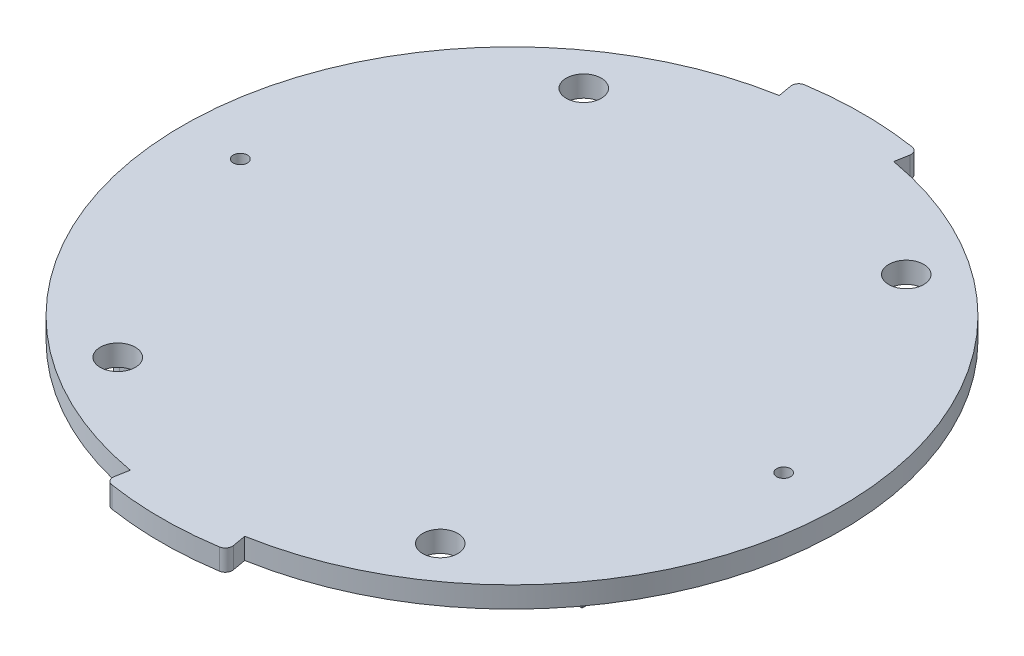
ISO-10303-21;
HEADER;
FILE_DESCRIPTION(('STEP AP214'),'2;1');
FILE_NAME('part.step','',(''),(''),'','','');
FILE_SCHEMA(('AUTOMOTIVE_DESIGN { 1 0 10303 214 1 1 1 1 }'));
ENDSEC;
DATA;
#1=APPLICATION_CONTEXT('core data for automotive mechanical design processes');
#2=APPLICATION_PROTOCOL_DEFINITION('international standard','automotive_design',2000,#1);
#3=PRODUCT_CONTEXT('',#1,'mechanical');
#4=PRODUCT('Part','Part','',(#3));
#5=PRODUCT_RELATED_PRODUCT_CATEGORY('part','',(#4));
#6=PRODUCT_DEFINITION_FORMATION('','',#4);
#7=PRODUCT_DEFINITION_CONTEXT('part definition',#1,'design');
#8=PRODUCT_DEFINITION('design','',#6,#7);
#9=PRODUCT_DEFINITION_SHAPE('','',#8);
#10=(LENGTH_UNIT() NAMED_UNIT(*) SI_UNIT(.MILLI.,.METRE.));
#11=(NAMED_UNIT(*) PLANE_ANGLE_UNIT() SI_UNIT($,.RADIAN.));
#12=(NAMED_UNIT(*) SI_UNIT($,.STERADIAN.) SOLID_ANGLE_UNIT());
#13=UNCERTAINTY_MEASURE_WITH_UNIT(LENGTH_MEASURE(1.E-05),#10,'distance_accuracy_value','');
#14=(GEOMETRIC_REPRESENTATION_CONTEXT(3) GLOBAL_UNCERTAINTY_ASSIGNED_CONTEXT((#13)) GLOBAL_UNIT_ASSIGNED_CONTEXT((#10,
#11,#12)) REPRESENTATION_CONTEXT('',''));
#15=CARTESIAN_POINT('',(0.,0.,0.));
#16=DIRECTION('',(0.,0.,1.));
#17=DIRECTION('',(1.,0.,0.));
#18=AXIS2_PLACEMENT_3D('',#15,#16,#17);
#19=CARTESIAN_POINT('',(0.,0.,0.));
#20=DIRECTION('',(0.,1.,0.));
#21=DIRECTION('',(0.,0.,1.));
#22=AXIS2_PLACEMENT_3D('',#19,#20,#21);
#23=PLANE('',#22);
#24=CARTESIAN_POINT('',(38.75,0.,0.));
#25=DIRECTION('',(0.,-1.,0.));
#26=DIRECTION('',(0.,0.,1.));
#27=AXIS2_PLACEMENT_3D('',#24,#25,#26);
#28=CIRCLE('',#27,0.999999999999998);
#29=CARTESIAN_POINT('',(38.75,0.,0.999999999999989));
#30=VERTEX_POINT('',#29);
#31=EDGE_CURVE('E650',#30,#30,#28,.T.);
#32=ORIENTED_EDGE('',*,*,#31,.F.);
#33=EDGE_LOOP('',(#32));
#34=FACE_BOUND('',#33,.T.);
#35=CARTESIAN_POINT('',(-38.75,0.,0.));
#36=DIRECTION('',(0.,-1.,0.));
#37=DIRECTION('',(0.,0.,-1.));
#38=AXIS2_PLACEMENT_3D('',#35,#36,#37);
#39=CIRCLE('',#38,0.999999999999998);
#40=CARTESIAN_POINT('',(-38.75,0.,-1.));
#41=VERTEX_POINT('',#40);
#42=EDGE_CURVE('E896',#41,#41,#39,.T.);
#43=ORIENTED_EDGE('',*,*,#42,.F.);
#44=EDGE_LOOP('',(#43));
#45=FACE_BOUND('',#44,.T.);
#46=DIRECTION('',(0.,0.,-1.));
#47=VECTOR('',#46,1.);
#48=CARTESIAN_POINT('',(-32.5,0.,22.5));
#49=LINE('',#48,#47);
#50=CARTESIAN_POINT('',(-32.5,0.,23.5));
#51=VERTEX_POINT('',#50);
#52=CARTESIAN_POINT('',(-32.5,0.,-22.5));
#53=VERTEX_POINT('',#52);
#54=EDGE_CURVE('E393',#51,#53,#49,.T.);
#55=ORIENTED_EDGE('',*,*,#54,.F.);
#56=CARTESIAN_POINT('',(-30.5,0.,23.5));
#57=DIRECTION('',(0.,1.,0.));
#58=DIRECTION('',(0.,0.,1.));
#59=AXIS2_PLACEMENT_3D('',#56,#57,#58);
#60=CIRCLE('',#59,2.);
#61=CARTESIAN_POINT('',(-30.5,0.,25.5));
#62=VERTEX_POINT('',#61);
#63=EDGE_CURVE('E567',#51,#62,#60,.T.);
#64=ORIENTED_EDGE('',*,*,#63,.T.);
#65=DIRECTION('',(-1.,0.,0.));
#66=VECTOR('',#65,1.);
#67=CARTESIAN_POINT('',(-32.5,0.,25.5));
#68=LINE('',#67,#66);
#69=CARTESIAN_POINT('',(-20.5,0.,25.5));
#70=VERTEX_POINT('',#69);
#71=EDGE_CURVE('E345',#70,#62,#68,.T.);
#72=ORIENTED_EDGE('',*,*,#71,.F.);
#73=DIRECTION('',(0.,0.,1.));
#74=VECTOR('',#73,1.);
#75=CARTESIAN_POINT('',(-20.5,0.,22.5));
#76=LINE('',#75,#74);
#77=CARTESIAN_POINT('',(-20.5,0.,24.5));
#78=VERTEX_POINT('',#77);
#79=EDGE_CURVE('E348',#78,#70,#76,.T.);
#80=ORIENTED_EDGE('',*,*,#79,.F.);
#81=CARTESIAN_POINT('',(-22.5,0.,24.5));
#82=DIRECTION('',(0.,1.,0.));
#83=DIRECTION('',(0.,0.,1.));
#84=AXIS2_PLACEMENT_3D('',#81,#82,#83);
#85=CIRCLE('',#84,2.);
#86=CARTESIAN_POINT('',(-22.5,0.,22.5));
#87=VERTEX_POINT('',#86);
#88=EDGE_CURVE('E564',#78,#87,#85,.T.);
#89=ORIENTED_EDGE('',*,*,#88,.T.);
#90=DIRECTION('',(1.,0.,0.));
#91=VECTOR('',#90,1.);
#92=CARTESIAN_POINT('',(-32.5,0.,22.5));
#93=LINE('',#92,#91);
#94=CARTESIAN_POINT('',(-29.5,0.,22.5));
#95=VERTEX_POINT('',#94);
#96=EDGE_CURVE('E341',#95,#87,#93,.T.);
#97=ORIENTED_EDGE('',*,*,#96,.F.);
#98=DIRECTION('',(0.,0.,1.));
#99=VECTOR('',#98,1.);
#100=CARTESIAN_POINT('',(-29.5,0.,22.5));
#101=LINE('',#100,#99);
#102=CARTESIAN_POINT('',(-29.5,0.,-20.5));
#103=VERTEX_POINT('',#102);
#104=EDGE_CURVE('E379',#103,#95,#101,.T.);
#105=ORIENTED_EDGE('',*,*,#104,.F.);
#106=CARTESIAN_POINT('',(-31.5,0.,-20.5));
#107=DIRECTION('',(0.,1.,0.));
#108=DIRECTION('',(0.,0.,1.));
#109=AXIS2_PLACEMENT_3D('',#106,#107,#108);
#110=CIRCLE('',#109,2.);
#111=CARTESIAN_POINT('',(-31.5,0.,-22.5));
#112=VERTEX_POINT('',#111);
#113=EDGE_CURVE('E571',#103,#112,#110,.T.);
#114=ORIENTED_EDGE('',*,*,#113,.T.);
#115=DIRECTION('',(1.,0.,0.));
#116=VECTOR('',#115,1.);
#117=CARTESIAN_POINT('',(-29.5,0.,-22.5));
#118=LINE('',#117,#116);
#119=EDGE_CURVE('E383',#53,#112,#118,.T.);
#120=ORIENTED_EDGE('',*,*,#119,.F.);
#121=EDGE_LOOP('',(#55,#64,#72,#80,#89,#97,#105,#114,#120));
#122=FACE_BOUND('',#121,.T.);
#123=DIRECTION('',(0.,0.,-1.));
#124=VECTOR('',#123,1.);
#125=CARTESIAN_POINT('',(-7.5,0.,28.5));
#126=LINE('',#125,#124);
#127=CARTESIAN_POINT('',(-7.49999999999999,0.,31.5));
#128=VERTEX_POINT('',#127);
#129=CARTESIAN_POINT('',(-7.5,0.,25.5));
#130=VERTEX_POINT('',#129);
#131=EDGE_CURVE('E52',#128,#130,#126,.T.);
#132=ORIENTED_EDGE('',*,*,#131,.F.);
#133=DIRECTION('',(1.,0.,0.));
#134=VECTOR('',#133,1.);
#135=CARTESIAN_POINT('',(7.5,0.,31.5));
#136=LINE('',#135,#134);
#137=CARTESIAN_POINT('',(7.50000000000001,0.,31.5));
#138=VERTEX_POINT('',#137);
#139=EDGE_CURVE('E658',#128,#138,#136,.T.);
#140=ORIENTED_EDGE('',*,*,#139,.T.);
#141=DIRECTION('',(0.,0.,1.));
#142=VECTOR('',#141,1.);
#143=CARTESIAN_POINT('',(7.5,0.,28.5));
#144=LINE('',#143,#142);
#145=CARTESIAN_POINT('',(7.5,0.,25.5));
#146=VERTEX_POINT('',#145);
#147=EDGE_CURVE('E60',#146,#138,#144,.T.);
#148=ORIENTED_EDGE('',*,*,#147,.F.);
#149=DIRECTION('',(1.,0.,0.));
#150=VECTOR('',#149,1.);
#151=CARTESIAN_POINT('',(-7.5,0.,25.5));
#152=LINE('',#151,#150);
#153=EDGE_CURVE('E439',#130,#146,#152,.T.);
#154=ORIENTED_EDGE('',*,*,#153,.F.);
#155=EDGE_LOOP('',(#132,#140,#148,#154));
#156=FACE_BOUND('',#155,.T.);
#157=CARTESIAN_POINT('',(-23.,0.,-33.2340187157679));
#158=DIRECTION('',(0.,1.,0.));
#159=DIRECTION('',(0.,0.,1.));
#160=AXIS2_PLACEMENT_3D('',#157,#158,#159);
#161=CIRCLE('',#160,2.5);
#162=CARTESIAN_POINT('',(-23.,0.,-30.7340187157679));
#163=VERTEX_POINT('',#162);
#164=EDGE_CURVE('E517',#163,#163,#161,.T.);
#165=ORIENTED_EDGE('',*,*,#164,.T.);
#166=EDGE_LOOP('',(#165));
#167=FACE_BOUND('',#166,.T.);
#168=CARTESIAN_POINT('',(23.,0.,-33.2340187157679));
#169=DIRECTION('',(0.,1.,0.));
#170=DIRECTION('',(0.,0.,-1.));
#171=AXIS2_PLACEMENT_3D('',#168,#169,#170);
#172=CIRCLE('',#171,2.5);
#173=CARTESIAN_POINT('',(23.,0.,-35.7340187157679));
#174=VERTEX_POINT('',#173);
#175=EDGE_CURVE('E511',#174,#174,#172,.T.);
#176=ORIENTED_EDGE('',*,*,#175,.T.);
#177=EDGE_LOOP('',(#176));
#178=FACE_BOUND('',#177,.T.);
#179=CARTESIAN_POINT('',(23.,0.,33.2340187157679));
#180=DIRECTION('',(0.,1.,0.));
#181=DIRECTION('',(0.,0.,1.));
#182=AXIS2_PLACEMENT_3D('',#179,#180,#181);
#183=CIRCLE('',#182,2.5);
#184=CARTESIAN_POINT('',(23.,0.,35.7340187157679));
#185=VERTEX_POINT('',#184);
#186=EDGE_CURVE('E505',#185,#185,#183,.T.);
#187=ORIENTED_EDGE('',*,*,#186,.T.);
#188=EDGE_LOOP('',(#187));
#189=FACE_BOUND('',#188,.T.);
#190=CARTESIAN_POINT('',(-23.,0.,33.2340187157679));
#191=DIRECTION('',(0.,1.,0.));
#192=DIRECTION('',(0.,0.,-1.));
#193=AXIS2_PLACEMENT_3D('',#190,#191,#192);
#194=CIRCLE('',#193,2.5);
#195=CARTESIAN_POINT('',(-23.,0.,30.7340187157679));
#196=VERTEX_POINT('',#195);
#197=EDGE_CURVE('E499',#196,#196,#194,.T.);
#198=ORIENTED_EDGE('',*,*,#197,.T.);
#199=EDGE_LOOP('',(#198));
#200=FACE_BOUND('',#199,.T.);
#201=CARTESIAN_POINT('',(0.,0.,0.));
#202=DIRECTION('',(0.,1.,0.));
#203=DIRECTION('',(0.,0.,1.));
#204=AXIS2_PLACEMENT_3D('',#201,#202,#203);
#205=CIRCLE('',#204,50.);
#206=CARTESIAN_POINT('',(7.67569474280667,0.,49.4073244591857));
#207=VERTEX_POINT('',#206);
#208=CARTESIAN_POINT('',(-7.67569474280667,0.,49.4073244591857));
#209=VERTEX_POINT('',#208);
#210=EDGE_CURVE('E469',#207,#209,#205,.F.);
#211=ORIENTED_EDGE('',*,*,#210,.T.);
#212=CARTESIAN_POINT('',(-7.52218084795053,0.,48.419177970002));
#213=DIRECTION('',(0.,1.,0.));
#214=DIRECTION('',(0.,0.,1.));
#215=AXIS2_PLACEMENT_3D('',#212,#213,#214);
#216=CIRCLE('',#215,1.);
#217=CARTESIAN_POINT('',(-8.50698860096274,0.,48.2455297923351));
#218=VERTEX_POINT('',#217);
#219=EDGE_CURVE('E628',#209,#218,#216,.F.);
#220=ORIENTED_EDGE('',*,*,#219,.T.);
#221=DIRECTION('',(0.173648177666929,0.,-0.984807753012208));
#222=VECTOR('',#221,1.);
#223=CARTESIAN_POINT('',(-8.16146435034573,0.,46.2859643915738));
#224=LINE('',#223,#222);
#225=CARTESIAN_POINT('',(-8.16146435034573,0.,46.2859643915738));
#226=VERTEX_POINT('',#225);
#227=EDGE_CURVE('E476',#218,#226,#224,.T.);
#228=ORIENTED_EDGE('',*,*,#227,.T.);
#229=CARTESIAN_POINT('',(0.,0.,0.));
#230=DIRECTION('',(0.,1.,0.));
#231=DIRECTION('',(0.,0.,1.));
#232=AXIS2_PLACEMENT_3D('',#229,#230,#231);
#233=CIRCLE('',#232,47.);
#234=CARTESIAN_POINT('',(-8.16146435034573,0.,-46.2859643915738));
#235=VERTEX_POINT('',#234);
#236=EDGE_CURVE('E495',#235,#226,#233,.T.);
#237=ORIENTED_EDGE('',*,*,#236,.F.);
#238=DIRECTION('',(-0.173648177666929,0.,-0.984807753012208));
#239=VECTOR('',#238,1.);
#240=CARTESIAN_POINT('',(-8.16146435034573,0.,-46.2859643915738));
#241=LINE('',#240,#239);
#242=CARTESIAN_POINT('',(-8.50698860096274,0.,-48.2455297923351));
#243=VERTEX_POINT('',#242);
#244=EDGE_CURVE('E451',#235,#243,#241,.T.);
#245=ORIENTED_EDGE('',*,*,#244,.T.);
#246=CARTESIAN_POINT('',(-7.52218084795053,0.,-48.419177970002));
#247=DIRECTION('',(0.,1.,0.));
#248=DIRECTION('',(0.,0.,1.));
#249=AXIS2_PLACEMENT_3D('',#246,#247,#248);
#250=CIRCLE('',#249,1.);
#251=CARTESIAN_POINT('',(-7.67569474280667,0.,-49.4073244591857));
#252=VERTEX_POINT('',#251);
#253=EDGE_CURVE('E622',#243,#252,#250,.F.);
#254=ORIENTED_EDGE('',*,*,#253,.T.);
#255=CARTESIAN_POINT('',(0.,0.,0.));
#256=DIRECTION('',(0.,1.,0.));
#257=DIRECTION('',(0.,0.,1.));
#258=AXIS2_PLACEMENT_3D('',#255,#256,#257);
#259=CIRCLE('',#258,50.);
#260=CARTESIAN_POINT('',(7.67569474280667,0.,-49.4073244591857));
#261=VERTEX_POINT('',#260);
#262=EDGE_CURVE('E448',#252,#261,#259,.F.);
#263=ORIENTED_EDGE('',*,*,#262,.T.);
#264=CARTESIAN_POINT('',(7.52218084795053,0.,-48.419177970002));
#265=DIRECTION('',(0.,1.,0.));
#266=DIRECTION('',(0.,0.,1.));
#267=AXIS2_PLACEMENT_3D('',#264,#265,#266);
#268=CIRCLE('',#267,1.);
#269=CARTESIAN_POINT('',(8.50698860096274,0.,-48.2455297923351));
#270=VERTEX_POINT('',#269);
#271=EDGE_CURVE('E624',#261,#270,#268,.F.);
#272=ORIENTED_EDGE('',*,*,#271,.T.);
#273=DIRECTION('',(-0.173648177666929,0.,0.984807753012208));
#274=VECTOR('',#273,1.);
#275=CARTESIAN_POINT('',(8.16146435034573,0.,-46.2859643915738));
#276=LINE('',#275,#274);
#277=CARTESIAN_POINT('',(8.16146435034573,0.,-46.2859643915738));
#278=VERTEX_POINT('',#277);
#279=EDGE_CURVE('E455',#270,#278,#276,.T.);
#280=ORIENTED_EDGE('',*,*,#279,.T.);
#281=CARTESIAN_POINT('',(8.16146435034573,0.,46.2859643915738));
#282=VERTEX_POINT('',#281);
#283=EDGE_CURVE('E491',#282,#278,#233,.T.);
#284=ORIENTED_EDGE('',*,*,#283,.F.);
#285=DIRECTION('',(0.173648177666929,0.,0.984807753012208));
#286=VECTOR('',#285,1.);
#287=CARTESIAN_POINT('',(8.16146435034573,0.,46.2859643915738));
#288=LINE('',#287,#286);
#289=CARTESIAN_POINT('',(8.50698860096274,0.,48.2455297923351));
#290=VERTEX_POINT('',#289);
#291=EDGE_CURVE('E472',#282,#290,#288,.T.);
#292=ORIENTED_EDGE('',*,*,#291,.T.);
#293=CARTESIAN_POINT('',(7.52218084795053,0.,48.419177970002));
#294=DIRECTION('',(0.,1.,0.));
#295=DIRECTION('',(0.,0.,1.));
#296=AXIS2_PLACEMENT_3D('',#293,#294,#295);
#297=CIRCLE('',#296,1.);
#298=EDGE_CURVE('E626',#290,#207,#297,.F.);
#299=ORIENTED_EDGE('',*,*,#298,.T.);
#300=EDGE_LOOP('',(#211,#220,#228,#237,#245,#254,#263,#272,#280,#284,#292,#299));
#301=FACE_BOUND('',#300,.T.);
#302=DIRECTION('',(0.,0.,1.));
#303=VECTOR('',#302,1.);
#304=CARTESIAN_POINT('',(7.5,0.,-28.5));
#305=LINE('',#304,#303);
#306=CARTESIAN_POINT('',(7.50000000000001,0.,-31.5));
#307=VERTEX_POINT('',#306);
#308=CARTESIAN_POINT('',(7.5,0.,-25.5));
#309=VERTEX_POINT('',#308);
#310=EDGE_CURVE('E402',#307,#309,#305,.T.);
#311=ORIENTED_EDGE('',*,*,#310,.F.);
#312=DIRECTION('',(-1.,0.,0.));
#313=VECTOR('',#312,1.);
#314=CARTESIAN_POINT('',(-7.5,0.,-31.5));
#315=LINE('',#314,#313);
#316=CARTESIAN_POINT('',(-7.49999999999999,0.,-31.5));
#317=VERTEX_POINT('',#316);
#318=EDGE_CURVE('E642',#307,#317,#315,.T.);
#319=ORIENTED_EDGE('',*,*,#318,.T.);
#320=DIRECTION('',(0.,0.,-1.));
#321=VECTOR('',#320,1.);
#322=CARTESIAN_POINT('',(-7.5,0.,-28.5));
#323=LINE('',#322,#321);
#324=CARTESIAN_POINT('',(-7.5,0.,-25.5));
#325=VERTEX_POINT('',#324);
#326=EDGE_CURVE('E407',#325,#317,#323,.T.);
#327=ORIENTED_EDGE('',*,*,#326,.F.);
#328=DIRECTION('',(-1.,0.,0.));
#329=VECTOR('',#328,1.);
#330=CARTESIAN_POINT('',(-7.5,0.,-25.5));
#331=LINE('',#330,#329);
#332=EDGE_CURVE('E417',#309,#325,#331,.T.);
#333=ORIENTED_EDGE('',*,*,#332,.F.);
#334=EDGE_LOOP('',(#311,#319,#327,#333));
#335=FACE_BOUND('',#334,.T.);
#336=DIRECTION('',(0.,0.,1.));
#337=VECTOR('',#336,1.);
#338=CARTESIAN_POINT('',(32.5,0.,22.5));
#339=LINE('',#338,#337);
#340=CARTESIAN_POINT('',(32.5,0.,-23.5));
#341=VERTEX_POINT('',#340);
#342=CARTESIAN_POINT('',(32.5,0.,22.5));
#343=VERTEX_POINT('',#342);
#344=EDGE_CURVE('E370',#341,#343,#339,.T.);
#345=ORIENTED_EDGE('',*,*,#344,.F.);
#346=CARTESIAN_POINT('',(30.5,0.,-23.5));
#347=DIRECTION('',(0.,1.,0.));
#348=DIRECTION('',(0.,0.,1.));
#349=AXIS2_PLACEMENT_3D('',#346,#347,#348);
#350=CIRCLE('',#349,2.);
#351=CARTESIAN_POINT('',(30.5,0.,-25.5));
#352=VERTEX_POINT('',#351);
#353=EDGE_CURVE('E335',#341,#352,#350,.T.);
#354=ORIENTED_EDGE('',*,*,#353,.T.);
#355=DIRECTION('',(1.,0.,0.));
#356=VECTOR('',#355,1.);
#357=CARTESIAN_POINT('',(32.5,0.,-25.5));
#358=LINE('',#357,#356);
#359=CARTESIAN_POINT('',(20.5,0.,-25.5));
#360=VERTEX_POINT('',#359);
#361=EDGE_CURVE('E317',#360,#352,#358,.T.);
#362=ORIENTED_EDGE('',*,*,#361,.F.);
#363=DIRECTION('',(0.,0.,-1.));
#364=VECTOR('',#363,1.);
#365=CARTESIAN_POINT('',(20.5,0.,-22.5));
#366=LINE('',#365,#364);
#367=CARTESIAN_POINT('',(20.5,0.,-24.5));
#368=VERTEX_POINT('',#367);
#369=EDGE_CURVE('E326',#368,#360,#366,.T.);
#370=ORIENTED_EDGE('',*,*,#369,.F.);
#371=CARTESIAN_POINT('',(22.5,0.,-24.5));
#372=DIRECTION('',(0.,1.,0.));
#373=DIRECTION('',(0.,0.,1.));
#374=AXIS2_PLACEMENT_3D('',#371,#372,#373);
#375=CIRCLE('',#374,2.);
#376=CARTESIAN_POINT('',(22.5,0.,-22.5));
#377=VERTEX_POINT('',#376);
#378=EDGE_CURVE('E562',#368,#377,#375,.T.);
#379=ORIENTED_EDGE('',*,*,#378,.T.);
#380=DIRECTION('',(-1.,0.,0.));
#381=VECTOR('',#380,1.);
#382=CARTESIAN_POINT('',(32.5,0.,-22.5));
#383=LINE('',#382,#381);
#384=CARTESIAN_POINT('',(29.5,0.,-22.5));
#385=VERTEX_POINT('',#384);
#386=EDGE_CURVE('E332',#385,#377,#383,.T.);
#387=ORIENTED_EDGE('',*,*,#386,.F.);
#388=DIRECTION('',(0.,0.,-1.));
#389=VECTOR('',#388,1.);
#390=CARTESIAN_POINT('',(29.5,0.,22.5));
#391=LINE('',#390,#389);
#392=CARTESIAN_POINT('',(29.5,0.,20.5));
#393=VERTEX_POINT('',#392);
#394=EDGE_CURVE('E356',#393,#385,#391,.T.);
#395=ORIENTED_EDGE('',*,*,#394,.F.);
#396=CARTESIAN_POINT('',(31.5,0.,20.5));
#397=DIRECTION('',(0.,1.,0.));
#398=DIRECTION('',(0.,0.,1.));
#399=AXIS2_PLACEMENT_3D('',#396,#397,#398);
#400=CIRCLE('',#399,2.);
#401=CARTESIAN_POINT('',(31.5,0.,22.5));
#402=VERTEX_POINT('',#401);
#403=EDGE_CURVE('E569',#393,#402,#400,.T.);
#404=ORIENTED_EDGE('',*,*,#403,.T.);
#405=DIRECTION('',(-1.,0.,0.));
#406=VECTOR('',#405,1.);
#407=CARTESIAN_POINT('',(29.5,0.,22.5));
#408=LINE('',#407,#406);
#409=EDGE_CURVE('E360',#343,#402,#408,.T.);
#410=ORIENTED_EDGE('',*,*,#409,.F.);
#411=EDGE_LOOP('',(#345,#354,#362,#370,#379,#387,#395,#404,#410));
#412=FACE_BOUND('',#411,.T.);
#413=ADVANCED_FACE('F37',(#34,#45,#122,#156,#167,#178,#189,#200,#301,#335,#412),#23,.F.);
#414=CARTESIAN_POINT('',(0.,0.,0.));
#415=DIRECTION('',(0.,1.,0.));
#416=DIRECTION('',(0.,0.,1.));
#417=AXIS2_PLACEMENT_3D('',#414,#415,#416);
#418=CYLINDRICAL_SURFACE('',#417,47.);
#419=DIRECTION('',(0.,1.,0.));
#420=VECTOR('',#419,1.);
#421=CARTESIAN_POINT('',(-8.16146435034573,-17.7575605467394,-46.2859643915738));
#422=LINE('',#421,#420);
#423=CARTESIAN_POINT('',(-8.16146435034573,3.,-46.2859643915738));
#424=VERTEX_POINT('',#423);
#425=EDGE_CURVE('E452',#235,#424,#422,.T.);
#426=ORIENTED_EDGE('',*,*,#425,.F.);
#427=ORIENTED_EDGE('',*,*,#236,.T.);
#428=DIRECTION('',(0.,1.,0.));
#429=VECTOR('',#428,1.);
#430=CARTESIAN_POINT('',(-8.16146435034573,-17.7575605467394,46.2859643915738));
#431=LINE('',#430,#429);
#432=CARTESIAN_POINT('',(-8.16146435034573,3.,46.2859643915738));
#433=VERTEX_POINT('',#432);
#434=EDGE_CURVE('E484',#226,#433,#431,.T.);
#435=ORIENTED_EDGE('',*,*,#434,.T.);
#436=CARTESIAN_POINT('',(0.,3.,0.));
#437=DIRECTION('',(0.,1.,0.));
#438=DIRECTION('',(0.,0.,1.));
#439=AXIS2_PLACEMENT_3D('',#436,#437,#438);
#440=CIRCLE('',#439,47.);
#441=EDGE_CURVE('E490',#424,#433,#440,.T.);
#442=ORIENTED_EDGE('',*,*,#441,.F.);
#443=EDGE_LOOP('',(#426,#427,#435,#442));
#444=FACE_BOUND('',#443,.T.);
#445=ADVANCED_FACE('F694',(#444),#418,.T.);
#446=CARTESIAN_POINT('',(0.,3.,0.));
#447=DIRECTION('',(0.,1.,0.));
#448=DIRECTION('',(0.,0.,1.));
#449=AXIS2_PLACEMENT_3D('',#446,#447,#448);
#450=PLANE('',#449);
#451=CARTESIAN_POINT('',(38.75,3.,0.));
#452=DIRECTION('',(0.,-1.,0.));
#453=DIRECTION('',(0.,0.,1.));
#454=AXIS2_PLACEMENT_3D('',#451,#452,#453);
#455=CIRCLE('',#454,0.999999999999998);
#456=CARTESIAN_POINT('',(38.75,3.,0.999999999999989));
#457=VERTEX_POINT('',#456);
#458=EDGE_CURVE('E891',#457,#457,#455,.T.);
#459=ORIENTED_EDGE('',*,*,#458,.T.);
#460=EDGE_LOOP('',(#459));
#461=FACE_BOUND('',#460,.T.);
#462=CARTESIAN_POINT('',(-38.75,3.,0.));
#463=DIRECTION('',(0.,-1.,0.));
#464=DIRECTION('',(0.,0.,-1.));
#465=AXIS2_PLACEMENT_3D('',#462,#463,#464);
#466=CIRCLE('',#465,0.999999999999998);
#467=CARTESIAN_POINT('',(-38.75,3.,-1.));
#468=VERTEX_POINT('',#467);
#469=EDGE_CURVE('E894',#468,#468,#466,.T.);
#470=ORIENTED_EDGE('',*,*,#469,.T.);
#471=EDGE_LOOP('',(#470));
#472=FACE_BOUND('',#471,.T.);
#473=CARTESIAN_POINT('',(-23.,3.,-33.2340187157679));
#474=DIRECTION('',(0.,1.,0.));
#475=DIRECTION('',(0.,0.,1.));
#476=AXIS2_PLACEMENT_3D('',#473,#474,#475);
#477=CIRCLE('',#476,2.5);
#478=CARTESIAN_POINT('',(-23.,3.,-30.7340187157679));
#479=VERTEX_POINT('',#478);
#480=EDGE_CURVE('E514',#479,#479,#477,.T.);
#481=ORIENTED_EDGE('',*,*,#480,.F.);
#482=EDGE_LOOP('',(#481));
#483=FACE_BOUND('',#482,.T.);
#484=CARTESIAN_POINT('',(23.,3.,-33.2340187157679));
#485=DIRECTION('',(0.,1.,0.));
#486=DIRECTION('',(0.,0.,-1.));
#487=AXIS2_PLACEMENT_3D('',#484,#485,#486);
#488=CIRCLE('',#487,2.5);
#489=CARTESIAN_POINT('',(23.,3.,-35.7340187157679));
#490=VERTEX_POINT('',#489);
#491=EDGE_CURVE('E508',#490,#490,#488,.T.);
#492=ORIENTED_EDGE('',*,*,#491,.F.);
#493=EDGE_LOOP('',(#492));
#494=FACE_BOUND('',#493,.T.);
#495=CARTESIAN_POINT('',(23.,3.,33.2340187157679));
#496=DIRECTION('',(0.,1.,0.));
#497=DIRECTION('',(0.,0.,1.));
#498=AXIS2_PLACEMENT_3D('',#495,#496,#497);
#499=CIRCLE('',#498,2.5);
#500=CARTESIAN_POINT('',(23.,3.,35.7340187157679));
#501=VERTEX_POINT('',#500);
#502=EDGE_CURVE('E502',#501,#501,#499,.T.);
#503=ORIENTED_EDGE('',*,*,#502,.F.);
#504=EDGE_LOOP('',(#503));
#505=FACE_BOUND('',#504,.T.);
#506=CARTESIAN_POINT('',(-23.,3.,33.2340187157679));
#507=DIRECTION('',(0.,1.,0.));
#508=DIRECTION('',(0.,0.,-1.));
#509=AXIS2_PLACEMENT_3D('',#506,#507,#508);
#510=CIRCLE('',#509,2.5);
#511=CARTESIAN_POINT('',(-23.,3.,30.7340187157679));
#512=VERTEX_POINT('',#511);
#513=EDGE_CURVE('E494',#512,#512,#510,.T.);
#514=ORIENTED_EDGE('',*,*,#513,.F.);
#515=EDGE_LOOP('',(#514));
#516=FACE_BOUND('',#515,.T.);
#517=DIRECTION('',(-0.173648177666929,0.,0.984807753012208));
#518=VECTOR('',#517,1.);
#519=CARTESIAN_POINT('',(-8.16146435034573,3.,46.2859643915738));
#520=LINE('',#519,#518);
#521=CARTESIAN_POINT('',(-8.50698860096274,3.,48.2455297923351));
#522=VERTEX_POINT('',#521);
#523=EDGE_CURVE('E468',#433,#522,#520,.T.);
#524=ORIENTED_EDGE('',*,*,#523,.T.);
#525=CARTESIAN_POINT('',(-7.52218084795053,3.,48.419177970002));
#526=DIRECTION('',(0.,1.,0.));
#527=DIRECTION('',(0.,0.,1.));
#528=AXIS2_PLACEMENT_3D('',#525,#526,#527);
#529=CIRCLE('',#528,1.);
#530=CARTESIAN_POINT('',(-7.67569474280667,3.,49.4073244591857));
#531=VERTEX_POINT('',#530);
#532=EDGE_CURVE('E615',#522,#531,#529,.T.);
#533=ORIENTED_EDGE('',*,*,#532,.T.);
#534=CARTESIAN_POINT('',(0.,3.,0.));
#535=DIRECTION('',(0.,1.,0.));
#536=DIRECTION('',(0.,0.,1.));
#537=AXIS2_PLACEMENT_3D('',#534,#535,#536);
#538=CIRCLE('',#537,50.);
#539=CARTESIAN_POINT('',(7.67569474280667,3.,49.4073244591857));
#540=VERTEX_POINT('',#539);
#541=EDGE_CURVE('E479',#531,#540,#538,.T.);
#542=ORIENTED_EDGE('',*,*,#541,.T.);
#543=CARTESIAN_POINT('',(7.52218084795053,3.,48.419177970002));
#544=DIRECTION('',(0.,1.,0.));
#545=DIRECTION('',(0.,0.,1.));
#546=AXIS2_PLACEMENT_3D('',#543,#544,#545);
#547=CIRCLE('',#546,1.);
#548=CARTESIAN_POINT('',(8.50698860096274,3.,48.2455297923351));
#549=VERTEX_POINT('',#548);
#550=EDGE_CURVE('E613',#540,#549,#547,.T.);
#551=ORIENTED_EDGE('',*,*,#550,.T.);
#552=DIRECTION('',(-0.173648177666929,0.,-0.984807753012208));
#553=VECTOR('',#552,1.);
#554=CARTESIAN_POINT('',(8.16146435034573,3.,46.2859643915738));
#555=LINE('',#554,#553);
#556=CARTESIAN_POINT('',(8.16146435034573,3.,46.2859643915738));
#557=VERTEX_POINT('',#556);
#558=EDGE_CURVE('E482',#549,#557,#555,.T.);
#559=ORIENTED_EDGE('',*,*,#558,.T.);
#560=CARTESIAN_POINT('',(8.16146435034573,3.,-46.2859643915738));
#561=VERTEX_POINT('',#560);
#562=EDGE_CURVE('E496',#557,#561,#440,.T.);
#563=ORIENTED_EDGE('',*,*,#562,.T.);
#564=DIRECTION('',(0.173648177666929,0.,-0.984807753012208));
#565=VECTOR('',#564,1.);
#566=CARTESIAN_POINT('',(8.16146435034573,3.,-46.2859643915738));
#567=LINE('',#566,#565);
#568=CARTESIAN_POINT('',(8.50698860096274,3.,-48.2455297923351));
#569=VERTEX_POINT('',#568);
#570=EDGE_CURVE('E447',#561,#569,#567,.T.);
#571=ORIENTED_EDGE('',*,*,#570,.T.);
#572=CARTESIAN_POINT('',(7.52218084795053,3.,-48.419177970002));
#573=DIRECTION('',(0.,1.,0.));
#574=DIRECTION('',(0.,0.,1.));
#575=AXIS2_PLACEMENT_3D('',#572,#573,#574);
#576=CIRCLE('',#575,1.);
#577=CARTESIAN_POINT('',(7.67569474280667,3.,-49.4073244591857));
#578=VERTEX_POINT('',#577);
#579=EDGE_CURVE('E611',#569,#578,#576,.T.);
#580=ORIENTED_EDGE('',*,*,#579,.T.);
#581=CARTESIAN_POINT('',(0.,3.,0.));
#582=DIRECTION('',(0.,1.,0.));
#583=DIRECTION('',(0.,0.,-1.));
#584=AXIS2_PLACEMENT_3D('',#581,#582,#583);
#585=CIRCLE('',#584,50.);
#586=CARTESIAN_POINT('',(-7.67569474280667,3.,-49.4073244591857));
#587=VERTEX_POINT('',#586);
#588=EDGE_CURVE('E458',#578,#587,#585,.T.);
#589=ORIENTED_EDGE('',*,*,#588,.T.);
#590=CARTESIAN_POINT('',(-7.52218084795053,3.,-48.419177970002));
#591=DIRECTION('',(0.,1.,0.));
#592=DIRECTION('',(0.,0.,1.));
#593=AXIS2_PLACEMENT_3D('',#590,#591,#592);
#594=CIRCLE('',#593,1.);
#595=CARTESIAN_POINT('',(-8.50698860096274,3.,-48.2455297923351));
#596=VERTEX_POINT('',#595);
#597=EDGE_CURVE('E609',#587,#596,#594,.T.);
#598=ORIENTED_EDGE('',*,*,#597,.T.);
#599=DIRECTION('',(0.173648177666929,0.,0.984807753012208));
#600=VECTOR('',#599,1.);
#601=CARTESIAN_POINT('',(-8.16146435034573,3.,-46.2859643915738));
#602=LINE('',#601,#600);
#603=EDGE_CURVE('E461',#596,#424,#602,.T.);
#604=ORIENTED_EDGE('',*,*,#603,.T.);
#605=ORIENTED_EDGE('',*,*,#441,.T.);
#606=EDGE_LOOP('',(#524,#533,#542,#551,#559,#563,#571,#580,#589,#598,#604,#605));
#607=FACE_BOUND('',#606,.T.);
#608=ADVANCED_FACE('F700',(#461,#472,#483,#494,#505,#516,#607),#450,.T.);
#609=CARTESIAN_POINT('',(-23.,0.,-33.2340187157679));
#610=DIRECTION('',(0.,1.,0.));
#611=DIRECTION('',(0.,0.,1.));
#612=AXIS2_PLACEMENT_3D('',#609,#610,#611);
#613=CYLINDRICAL_SURFACE('',#612,2.5);
#614=ORIENTED_EDGE('',*,*,#164,.F.);
#615=EDGE_LOOP('',(#614));
#616=FACE_BOUND('',#615,.T.);
#617=ORIENTED_EDGE('',*,*,#480,.T.);
#618=EDGE_LOOP('',(#617));
#619=FACE_BOUND('',#618,.T.);
#620=ADVANCED_FACE('F866',(#616,#619),#613,.F.);
#621=CARTESIAN_POINT('',(23.,0.,-33.2340187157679));
#622=DIRECTION('',(0.,1.,0.));
#623=DIRECTION('',(0.,0.,1.));
#624=AXIS2_PLACEMENT_3D('',#621,#622,#623);
#625=CYLINDRICAL_SURFACE('',#624,2.5);
#626=ORIENTED_EDGE('',*,*,#175,.F.);
#627=EDGE_LOOP('',(#626));
#628=FACE_BOUND('',#627,.T.);
#629=ORIENTED_EDGE('',*,*,#491,.T.);
#630=EDGE_LOOP('',(#629));
#631=FACE_BOUND('',#630,.T.);
#632=ADVANCED_FACE('F863',(#628,#631),#625,.F.);
#633=CARTESIAN_POINT('',(23.,0.,33.2340187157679));
#634=DIRECTION('',(0.,1.,0.));
#635=DIRECTION('',(0.,0.,1.));
#636=AXIS2_PLACEMENT_3D('',#633,#634,#635);
#637=CYLINDRICAL_SURFACE('',#636,2.5);
#638=ORIENTED_EDGE('',*,*,#186,.F.);
#639=EDGE_LOOP('',(#638));
#640=FACE_BOUND('',#639,.T.);
#641=ORIENTED_EDGE('',*,*,#502,.T.);
#642=EDGE_LOOP('',(#641));
#643=FACE_BOUND('',#642,.T.);
#644=ADVANCED_FACE('F859',(#640,#643),#637,.F.);
#645=CARTESIAN_POINT('',(-23.,0.,33.2340187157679));
#646=DIRECTION('',(0.,1.,0.));
#647=DIRECTION('',(0.,0.,1.));
#648=AXIS2_PLACEMENT_3D('',#645,#646,#647);
#649=CYLINDRICAL_SURFACE('',#648,2.5);
#650=ORIENTED_EDGE('',*,*,#197,.F.);
#651=EDGE_LOOP('',(#650));
#652=FACE_BOUND('',#651,.T.);
#653=ORIENTED_EDGE('',*,*,#513,.T.);
#654=EDGE_LOOP('',(#653));
#655=FACE_BOUND('',#654,.T.);
#656=ADVANCED_FACE('F856',(#652,#655),#649,.F.);
#657=DIRECTION('',(0.,1.,0.));
#658=VECTOR('',#657,1.);
#659=CARTESIAN_POINT('',(8.16146435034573,-17.7575605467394,-46.2859643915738));
#660=LINE('',#659,#658);
#661=EDGE_CURVE('E463',#278,#561,#660,.T.);
#662=ORIENTED_EDGE('',*,*,#661,.T.);
#663=ORIENTED_EDGE('',*,*,#562,.F.);
#664=DIRECTION('',(0.,1.,0.));
#665=VECTOR('',#664,1.);
#666=CARTESIAN_POINT('',(8.16146435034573,-17.7575605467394,46.2859643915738));
#667=LINE('',#666,#665);
#668=EDGE_CURVE('E473',#282,#557,#667,.T.);
#669=ORIENTED_EDGE('',*,*,#668,.F.);
#670=ORIENTED_EDGE('',*,*,#283,.T.);
#671=EDGE_LOOP('',(#662,#663,#669,#670));
#672=FACE_BOUND('',#671,.T.);
#673=ADVANCED_FACE('F703',(#672),#418,.T.);
#674=CARTESIAN_POINT('',(8.16146435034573,-17.7575605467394,46.2859643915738));
#675=DIRECTION('',(0.984807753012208,0.,-0.173648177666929));
#676=DIRECTION('',(-0.173648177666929,0.,-0.984807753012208));
#677=AXIS2_PLACEMENT_3D('',#674,#675,#676);
#678=PLANE('',#677);
#679=ORIENTED_EDGE('',*,*,#558,.F.);
#680=DIRECTION('',(0.,1.,0.));
#681=VECTOR('',#680,1.);
#682=CARTESIAN_POINT('',(8.50698860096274,-17.7575605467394,48.2455297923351));
#683=LINE('',#682,#681);
#684=EDGE_CURVE('E630',#549,#290,#683,.F.);
#685=ORIENTED_EDGE('',*,*,#684,.T.);
#686=ORIENTED_EDGE('',*,*,#291,.F.);
#687=ORIENTED_EDGE('',*,*,#668,.T.);
#688=EDGE_LOOP('',(#679,#685,#686,#687));
#689=FACE_BOUND('',#688,.T.);
#690=ADVANCED_FACE('F841',(#689),#678,.T.);
#691=CARTESIAN_POINT('',(0.,-17.7575605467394,0.));
#692=DIRECTION('',(0.,1.,0.));
#693=DIRECTION('',(0.,0.,1.));
#694=AXIS2_PLACEMENT_3D('',#691,#692,#693);
#695=CYLINDRICAL_SURFACE('',#694,50.);
#696=ORIENTED_EDGE('',*,*,#541,.F.);
#697=DIRECTION('',(0.,1.,0.));
#698=VECTOR('',#697,1.);
#699=CARTESIAN_POINT('',(-7.67569474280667,-17.7575605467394,49.4073244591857));
#700=LINE('',#699,#698);
#701=EDGE_CURVE('E620',#531,#209,#700,.F.);
#702=ORIENTED_EDGE('',*,*,#701,.T.);
#703=ORIENTED_EDGE('',*,*,#210,.F.);
#704=DIRECTION('',(0.,1.,0.));
#705=VECTOR('',#704,1.);
#706=CARTESIAN_POINT('',(7.67569474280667,-17.7575605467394,49.4073244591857));
#707=LINE('',#706,#705);
#708=EDGE_CURVE('E617',#207,#540,#707,.T.);
#709=ORIENTED_EDGE('',*,*,#708,.T.);
#710=EDGE_LOOP('',(#696,#702,#703,#709));
#711=FACE_BOUND('',#710,.T.);
#712=ADVANCED_FACE('F843',(#711),#695,.T.);
#713=CARTESIAN_POINT('',(-8.16146435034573,-17.7575605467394,46.2859643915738));
#714=DIRECTION('',(-0.984807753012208,0.,-0.173648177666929));
#715=DIRECTION('',(-0.173648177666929,0.,0.984807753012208));
#716=AXIS2_PLACEMENT_3D('',#713,#714,#715);
#717=PLANE('',#716);
#718=ORIENTED_EDGE('',*,*,#227,.F.);
#719=DIRECTION('',(0.,1.,0.));
#720=VECTOR('',#719,1.);
#721=CARTESIAN_POINT('',(-8.50698860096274,-17.7575605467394,48.2455297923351));
#722=LINE('',#721,#720);
#723=EDGE_CURVE('E606',#218,#522,#722,.T.);
#724=ORIENTED_EDGE('',*,*,#723,.T.);
#725=ORIENTED_EDGE('',*,*,#523,.F.);
#726=ORIENTED_EDGE('',*,*,#434,.F.);
#727=EDGE_LOOP('',(#718,#724,#725,#726));
#728=FACE_BOUND('',#727,.T.);
#729=ADVANCED_FACE('F810',(#728),#717,.T.);
#730=CARTESIAN_POINT('',(-8.16146435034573,-17.7575605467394,-46.2859643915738));
#731=DIRECTION('',(-0.984807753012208,0.,0.173648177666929));
#732=DIRECTION('',(0.173648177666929,0.,0.984807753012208));
#733=AXIS2_PLACEMENT_3D('',#730,#731,#732);
#734=PLANE('',#733);
#735=ORIENTED_EDGE('',*,*,#603,.F.);
#736=DIRECTION('',(0.,1.,0.));
#737=VECTOR('',#736,1.);
#738=CARTESIAN_POINT('',(-8.50698860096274,-17.7575605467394,-48.2455297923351));
#739=LINE('',#738,#737);
#740=EDGE_CURVE('E640',#596,#243,#739,.F.);
#741=ORIENTED_EDGE('',*,*,#740,.T.);
#742=ORIENTED_EDGE('',*,*,#244,.F.);
#743=ORIENTED_EDGE('',*,*,#425,.T.);
#744=EDGE_LOOP('',(#735,#741,#742,#743));
#745=FACE_BOUND('',#744,.T.);
#746=ADVANCED_FACE('F850',(#745),#734,.T.);
#747=CARTESIAN_POINT('',(0.,-17.7575605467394,0.));
#748=DIRECTION('',(0.,1.,0.));
#749=DIRECTION('',(0.,0.,1.));
#750=AXIS2_PLACEMENT_3D('',#747,#748,#749);
#751=CYLINDRICAL_SURFACE('',#750,50.);
#752=ORIENTED_EDGE('',*,*,#588,.F.);
#753=DIRECTION('',(0.,1.,0.));
#754=VECTOR('',#753,1.);
#755=CARTESIAN_POINT('',(7.67569474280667,-17.7575605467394,-49.4073244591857));
#756=LINE('',#755,#754);
#757=EDGE_CURVE('E638',#578,#261,#756,.F.);
#758=ORIENTED_EDGE('',*,*,#757,.T.);
#759=ORIENTED_EDGE('',*,*,#262,.F.);
#760=DIRECTION('',(0.,1.,0.));
#761=VECTOR('',#760,1.);
#762=CARTESIAN_POINT('',(-7.67569474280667,-17.7575605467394,-49.4073244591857));
#763=LINE('',#762,#761);
#764=EDGE_CURVE('E635',#252,#587,#763,.T.);
#765=ORIENTED_EDGE('',*,*,#764,.T.);
#766=EDGE_LOOP('',(#752,#758,#759,#765));
#767=FACE_BOUND('',#766,.T.);
#768=ADVANCED_FACE('F826',(#767),#751,.T.);
#769=CARTESIAN_POINT('',(8.16146435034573,-17.7575605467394,-46.2859643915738));
#770=DIRECTION('',(0.984807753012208,0.,0.173648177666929));
#771=DIRECTION('',(0.173648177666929,0.,-0.984807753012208));
#772=AXIS2_PLACEMENT_3D('',#769,#770,#771);
#773=PLANE('',#772);
#774=ORIENTED_EDGE('',*,*,#279,.F.);
#775=DIRECTION('',(0.,1.,0.));
#776=VECTOR('',#775,1.);
#777=CARTESIAN_POINT('',(8.50698860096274,-17.7575605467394,-48.2455297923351));
#778=LINE('',#777,#776);
#779=EDGE_CURVE('E632',#270,#569,#778,.T.);
#780=ORIENTED_EDGE('',*,*,#779,.T.);
#781=ORIENTED_EDGE('',*,*,#570,.F.);
#782=ORIENTED_EDGE('',*,*,#661,.F.);
#783=EDGE_LOOP('',(#774,#780,#781,#782));
#784=FACE_BOUND('',#783,.T.);
#785=ADVANCED_FACE('F833',(#784),#773,.T.);
#786=CARTESIAN_POINT('',(-7.5,-3.,28.5));
#787=DIRECTION('',(1.,0.,0.));
#788=DIRECTION('',(0.,0.,-1.));
#789=AXIS2_PLACEMENT_3D('',#786,#787,#788);
#790=PLANE('',#789);
#791=ORIENTED_EDGE('',*,*,#131,.T.);
#792=DIRECTION('',(0.,1.,0.));
#793=VECTOR('',#792,1.);
#794=CARTESIAN_POINT('',(-7.5,-3.,25.5));
#795=LINE('',#794,#793);
#796=CARTESIAN_POINT('',(-7.5,-3.,25.5));
#797=VERTEX_POINT('',#796);
#798=EDGE_CURVE('E444',#797,#130,#795,.T.);
#799=ORIENTED_EDGE('',*,*,#798,.F.);
#800=DIRECTION('',(0.,0.,-1.));
#801=VECTOR('',#800,1.);
#802=CARTESIAN_POINT('',(-7.5,-3.,28.5));
#803=LINE('',#802,#801);
#804=CARTESIAN_POINT('',(-7.5,-3.,28.5));
#805=VERTEX_POINT('',#804);
#806=EDGE_CURVE('E426',#805,#797,#803,.T.);
#807=ORIENTED_EDGE('',*,*,#806,.F.);
#808=DIRECTION('',(0.,-0.707106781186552,-0.707106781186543));
#809=VECTOR('',#808,1.);
#810=CARTESIAN_POINT('',(-7.5,-3.00000000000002,28.5));
#811=LINE('',#810,#809);
#812=EDGE_CURVE('E660',#805,#128,#811,.F.);
#813=ORIENTED_EDGE('',*,*,#812,.T.);
#814=EDGE_LOOP('',(#791,#799,#807,#813));
#815=FACE_BOUND('',#814,.T.);
#816=ADVANCED_FACE('F1126',(#815),#790,.F.);
#817=CARTESIAN_POINT('',(-7.5,-3.,25.5));
#818=DIRECTION('',(0.,0.,1.));
#819=DIRECTION('',(1.,0.,0.));
#820=AXIS2_PLACEMENT_3D('',#817,#818,#819);
#821=PLANE('',#820);
#822=ORIENTED_EDGE('',*,*,#153,.T.);
#823=DIRECTION('',(0.,1.,0.));
#824=VECTOR('',#823,1.);
#825=CARTESIAN_POINT('',(7.5,-3.,25.5));
#826=LINE('',#825,#824);
#827=CARTESIAN_POINT('',(7.5,-3.,25.5));
#828=VERTEX_POINT('',#827);
#829=EDGE_CURVE('E437',#828,#146,#826,.T.);
#830=ORIENTED_EDGE('',*,*,#829,.F.);
#831=DIRECTION('',(1.,0.,0.));
#832=VECTOR('',#831,1.);
#833=CARTESIAN_POINT('',(-7.5,-3.,25.5));
#834=LINE('',#833,#832);
#835=EDGE_CURVE('E429',#797,#828,#834,.T.);
#836=ORIENTED_EDGE('',*,*,#835,.F.);
#837=ORIENTED_EDGE('',*,*,#798,.T.);
#838=EDGE_LOOP('',(#822,#830,#836,#837));
#839=FACE_BOUND('',#838,.T.);
#840=ADVANCED_FACE('F790',(#839),#821,.F.);
#841=CARTESIAN_POINT('',(7.5,-3.,28.5));
#842=DIRECTION('',(-1.,0.,0.));
#843=DIRECTION('',(0.,0.,1.));
#844=AXIS2_PLACEMENT_3D('',#841,#842,#843);
#845=PLANE('',#844);
#846=ORIENTED_EDGE('',*,*,#147,.T.);
#847=DIRECTION('',(0.,0.707106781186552,0.707106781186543));
#848=VECTOR('',#847,1.);
#849=CARTESIAN_POINT('',(7.5,-3.00000000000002,28.5));
#850=LINE('',#849,#848);
#851=CARTESIAN_POINT('',(7.5,-3.,28.5));
#852=VERTEX_POINT('',#851);
#853=EDGE_CURVE('E662',#138,#852,#850,.F.);
#854=ORIENTED_EDGE('',*,*,#853,.T.);
#855=DIRECTION('',(0.,0.,1.));
#856=VECTOR('',#855,1.);
#857=CARTESIAN_POINT('',(7.5,-3.,28.5));
#858=LINE('',#857,#856);
#859=EDGE_CURVE('E431',#828,#852,#858,.T.);
#860=ORIENTED_EDGE('',*,*,#859,.F.);
#861=ORIENTED_EDGE('',*,*,#829,.T.);
#862=EDGE_LOOP('',(#846,#854,#860,#861));
#863=FACE_BOUND('',#862,.T.);
#864=ADVANCED_FACE('F783',(#863),#845,.F.);
#865=CARTESIAN_POINT('',(0.,-3.,0.));
#866=DIRECTION('',(0.,-1.,0.));
#867=DIRECTION('',(0.,0.,-1.));
#868=AXIS2_PLACEMENT_3D('',#865,#866,#867);
#869=PLANE('',#868);
#870=ORIENTED_EDGE('',*,*,#806,.T.);
#871=ORIENTED_EDGE('',*,*,#835,.T.);
#872=ORIENTED_EDGE('',*,*,#859,.T.);
#873=DIRECTION('',(-1.,0.,0.));
#874=VECTOR('',#873,1.);
#875=CARTESIAN_POINT('',(-7.5,-3.,28.5));
#876=LINE('',#875,#874);
#877=EDGE_CURVE('E434',#852,#805,#876,.T.);
#878=ORIENTED_EDGE('',*,*,#877,.T.);
#879=EDGE_LOOP('',(#870,#871,#872,#878));
#880=FACE_BOUND('',#879,.T.);
#881=ADVANCED_FACE('F785',(#880),#869,.T.);
#882=CARTESIAN_POINT('',(7.5,-3.,-28.5));
#883=DIRECTION('',(-1.,0.,0.));
#884=DIRECTION('',(0.,0.,1.));
#885=AXIS2_PLACEMENT_3D('',#882,#883,#884);
#886=PLANE('',#885);
#887=ORIENTED_EDGE('',*,*,#310,.T.);
#888=DIRECTION('',(0.,1.,0.));
#889=VECTOR('',#888,1.);
#890=CARTESIAN_POINT('',(7.5,-3.,-25.5));
#891=LINE('',#890,#889);
#892=CARTESIAN_POINT('',(7.5,-3.,-25.5));
#893=VERTEX_POINT('',#892);
#894=EDGE_CURVE('E423',#893,#309,#891,.T.);
#895=ORIENTED_EDGE('',*,*,#894,.F.);
#896=DIRECTION('',(0.,0.,1.));
#897=VECTOR('',#896,1.);
#898=CARTESIAN_POINT('',(7.5,-3.,-28.5));
#899=LINE('',#898,#897);
#900=CARTESIAN_POINT('',(7.5,-3.,-28.5));
#901=VERTEX_POINT('',#900);
#902=EDGE_CURVE('E406',#901,#893,#899,.T.);
#903=ORIENTED_EDGE('',*,*,#902,.F.);
#904=DIRECTION('',(0.,-0.707106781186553,0.707106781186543));
#905=VECTOR('',#904,1.);
#906=CARTESIAN_POINT('',(7.5,-3.,-28.5));
#907=LINE('',#906,#905);
#908=EDGE_CURVE('E45',#901,#307,#907,.F.);
#909=ORIENTED_EDGE('',*,*,#908,.T.);
#910=EDGE_LOOP('',(#887,#895,#903,#909));
#911=FACE_BOUND('',#910,.T.);
#912=ADVANCED_FACE('F667',(#911),#886,.F.);
#913=CARTESIAN_POINT('',(-7.5,-3.,-25.5));
#914=DIRECTION('',(0.,0.,-1.));
#915=DIRECTION('',(-1.,0.,0.));
#916=AXIS2_PLACEMENT_3D('',#913,#914,#915);
#917=PLANE('',#916);
#918=ORIENTED_EDGE('',*,*,#332,.T.);
#919=DIRECTION('',(0.,1.,0.));
#920=VECTOR('',#919,1.);
#921=CARTESIAN_POINT('',(-7.5,-3.,-25.5));
#922=LINE('',#921,#920);
#923=CARTESIAN_POINT('',(-7.5,-3.,-25.5));
#924=VERTEX_POINT('',#923);
#925=EDGE_CURVE('E414',#924,#325,#922,.T.);
#926=ORIENTED_EDGE('',*,*,#925,.F.);
#927=DIRECTION('',(-1.,0.,0.));
#928=VECTOR('',#927,1.);
#929=CARTESIAN_POINT('',(-7.5,-3.,-25.5));
#930=LINE('',#929,#928);
#931=EDGE_CURVE('E409',#893,#924,#930,.T.);
#932=ORIENTED_EDGE('',*,*,#931,.F.);
#933=ORIENTED_EDGE('',*,*,#894,.T.);
#934=EDGE_LOOP('',(#918,#926,#932,#933));
#935=FACE_BOUND('',#934,.T.);
#936=ADVANCED_FACE('F675',(#935),#917,.F.);
#937=CARTESIAN_POINT('',(-7.5,-3.,-28.5));
#938=DIRECTION('',(1.,0.,0.));
#939=DIRECTION('',(0.,0.,-1.));
#940=AXIS2_PLACEMENT_3D('',#937,#938,#939);
#941=PLANE('',#940);
#942=ORIENTED_EDGE('',*,*,#326,.T.);
#943=DIRECTION('',(0.,0.707106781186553,-0.707106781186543));
#944=VECTOR('',#943,1.);
#945=CARTESIAN_POINT('',(-7.5,-3.,-28.5));
#946=LINE('',#945,#944);
#947=CARTESIAN_POINT('',(-7.5,-3.,-28.5));
#948=VERTEX_POINT('',#947);
#949=EDGE_CURVE('E11',#317,#948,#946,.F.);
#950=ORIENTED_EDGE('',*,*,#949,.T.);
#951=DIRECTION('',(0.,0.,-1.));
#952=VECTOR('',#951,1.);
#953=CARTESIAN_POINT('',(-7.5,-3.,-28.5));
#954=LINE('',#953,#952);
#955=EDGE_CURVE('E411',#924,#948,#954,.T.);
#956=ORIENTED_EDGE('',*,*,#955,.F.);
#957=ORIENTED_EDGE('',*,*,#925,.T.);
#958=EDGE_LOOP('',(#942,#950,#956,#957));
#959=FACE_BOUND('',#958,.T.);
#960=ADVANCED_FACE('F679',(#959),#941,.F.);
#961=CARTESIAN_POINT('',(0.,-3.,0.));
#962=DIRECTION('',(0.,-1.,0.));
#963=DIRECTION('',(0.,0.,-1.));
#964=AXIS2_PLACEMENT_3D('',#961,#962,#963);
#965=PLANE('',#964);
#966=DIRECTION('',(1.,0.,0.));
#967=VECTOR('',#966,1.);
#968=CARTESIAN_POINT('',(-7.5,-3.,-28.5));
#969=LINE('',#968,#967);
#970=EDGE_CURVE('E403',#948,#901,#969,.T.);
#971=ORIENTED_EDGE('',*,*,#970,.T.);
#972=ORIENTED_EDGE('',*,*,#902,.T.);
#973=ORIENTED_EDGE('',*,*,#931,.T.);
#974=ORIENTED_EDGE('',*,*,#955,.T.);
#975=EDGE_LOOP('',(#971,#972,#973,#974));
#976=FACE_BOUND('',#975,.T.);
#977=ADVANCED_FACE('F681',(#976),#965,.T.);
#978=CARTESIAN_POINT('',(-29.5,-5.6,22.5));
#979=DIRECTION('',(-1.,0.,0.));
#980=DIRECTION('',(0.,0.,1.));
#981=AXIS2_PLACEMENT_3D('',#978,#979,#980);
#982=PLANE('',#981);
#983=DIRECTION('',(0.,0.,1.));
#984=VECTOR('',#983,1.);
#985=CARTESIAN_POINT('',(-29.5,-5.6,22.5));
#986=LINE('',#985,#984);
#987=CARTESIAN_POINT('',(-29.5,-5.6,-20.5));
#988=VERTEX_POINT('',#987);
#989=CARTESIAN_POINT('',(-29.5,-5.6,22.5));
#990=VERTEX_POINT('',#989);
#991=EDGE_CURVE('E380',#988,#990,#986,.T.);
#992=ORIENTED_EDGE('',*,*,#991,.F.);
#993=DIRECTION('',(0.,1.,0.));
#994=VECTOR('',#993,1.);
#995=CARTESIAN_POINT('',(-29.5,-5.6,-20.5));
#996=LINE('',#995,#994);
#997=EDGE_CURVE('E555',#988,#103,#996,.T.);
#998=ORIENTED_EDGE('',*,*,#997,.T.);
#999=ORIENTED_EDGE('',*,*,#104,.T.);
#1000=DIRECTION('',(0.,1.,0.));
#1001=VECTOR('',#1000,1.);
#1002=CARTESIAN_POINT('',(-29.5,-5.6,22.5));
#1003=LINE('',#1002,#1001);
#1004=EDGE_CURVE('E399',#990,#95,#1003,.T.);
#1005=ORIENTED_EDGE('',*,*,#1004,.F.);
#1006=EDGE_LOOP('',(#992,#998,#999,#1005));
#1007=FACE_BOUND('',#1006,.T.);
#1008=ADVANCED_FACE('F683',(#1007),#982,.F.);
#1009=CARTESIAN_POINT('',(-32.5,-5.6,22.5));
#1010=DIRECTION('',(1.,0.,0.));
#1011=DIRECTION('',(0.,0.,-1.));
#1012=AXIS2_PLACEMENT_3D('',#1009,#1010,#1011);
#1013=PLANE('',#1012);
#1014=DIRECTION('',(0.,1.,0.));
#1015=VECTOR('',#1014,1.);
#1016=CARTESIAN_POINT('',(-32.5,-8.6,22.5));
#1017=LINE('',#1016,#1015);
#1018=CARTESIAN_POINT('',(-32.5,-7.6,22.5));
#1019=VERTEX_POINT('',#1018);
#1020=CARTESIAN_POINT('',(-32.5,-5.6,22.5));
#1021=VERTEX_POINT('',#1020);
#1022=EDGE_CURVE('E354',#1019,#1021,#1017,.T.);
#1023=ORIENTED_EDGE('',*,*,#1022,.F.);
#1024=CARTESIAN_POINT('',(-32.5,-7.6,23.5));
#1025=DIRECTION('',(1.,0.,0.));
#1026=DIRECTION('',(0.,0.,-1.));
#1027=AXIS2_PLACEMENT_3D('',#1024,#1025,#1026);
#1028=CIRCLE('',#1027,1.);
#1029=CARTESIAN_POINT('',(-32.5,-8.6,23.5));
#1030=VERTEX_POINT('',#1029);
#1031=EDGE_CURVE('E604',#1019,#1030,#1028,.F.);
#1032=ORIENTED_EDGE('',*,*,#1031,.T.);
#1033=DIRECTION('',(0.,1.,0.));
#1034=VECTOR('',#1033,1.);
#1035=CARTESIAN_POINT('',(-32.5,-5.6,23.5));
#1036=LINE('',#1035,#1034);
#1037=EDGE_CURVE('E542',#1030,#51,#1036,.T.);
#1038=ORIENTED_EDGE('',*,*,#1037,.T.);
#1039=ORIENTED_EDGE('',*,*,#54,.T.);
#1040=DIRECTION('',(0.,1.,0.));
#1041=VECTOR('',#1040,1.);
#1042=CARTESIAN_POINT('',(-32.5,-5.6,-22.5));
#1043=LINE('',#1042,#1041);
#1044=CARTESIAN_POINT('',(-32.5,-5.6,-22.5));
#1045=VERTEX_POINT('',#1044);
#1046=EDGE_CURVE('E391',#1045,#53,#1043,.T.);
#1047=ORIENTED_EDGE('',*,*,#1046,.F.);
#1048=DIRECTION('',(0.,0.,-1.));
#1049=VECTOR('',#1048,1.);
#1050=CARTESIAN_POINT('',(-32.5,-5.6,22.5));
#1051=LINE('',#1050,#1049);
#1052=EDGE_CURVE('E386',#1021,#1045,#1051,.T.);
#1053=ORIENTED_EDGE('',*,*,#1052,.F.);
#1054=EDGE_LOOP('',(#1023,#1032,#1038,#1039,#1047,#1053));
#1055=FACE_BOUND('',#1054,.T.);
#1056=ADVANCED_FACE('F689',(#1055),#1013,.F.);
#1057=CARTESIAN_POINT('',(-29.5,-5.6,-22.5));
#1058=DIRECTION('',(0.,0.,1.));
#1059=DIRECTION('',(1.,0.,0.));
#1060=AXIS2_PLACEMENT_3D('',#1057,#1058,#1059);
#1061=PLANE('',#1060);
#1062=ORIENTED_EDGE('',*,*,#119,.T.);
#1063=DIRECTION('',(0.,1.,0.));
#1064=VECTOR('',#1063,1.);
#1065=CARTESIAN_POINT('',(-31.5,-5.6,-22.5));
#1066=LINE('',#1065,#1064);
#1067=CARTESIAN_POINT('',(-31.5,-5.6,-22.5));
#1068=VERTEX_POINT('',#1067);
#1069=EDGE_CURVE('E558',#112,#1068,#1066,.F.);
#1070=ORIENTED_EDGE('',*,*,#1069,.T.);
#1071=DIRECTION('',(1.,0.,0.));
#1072=VECTOR('',#1071,1.);
#1073=CARTESIAN_POINT('',(-29.5,-5.6,-22.5));
#1074=LINE('',#1073,#1072);
#1075=EDGE_CURVE('E388',#1045,#1068,#1074,.T.);
#1076=ORIENTED_EDGE('',*,*,#1075,.F.);
#1077=ORIENTED_EDGE('',*,*,#1046,.T.);
#1078=EDGE_LOOP('',(#1062,#1070,#1076,#1077));
#1079=FACE_BOUND('',#1078,.T.);
#1080=ADVANCED_FACE('F961',(#1079),#1061,.F.);
#1081=CARTESIAN_POINT('',(0.,-5.6,0.));
#1082=DIRECTION('',(0.,1.,0.));
#1083=DIRECTION('',(0.,0.,1.));
#1084=AXIS2_PLACEMENT_3D('',#1081,#1082,#1083);
#1085=PLANE('',#1084);
#1086=ORIENTED_EDGE('',*,*,#1075,.T.);
#1087=CARTESIAN_POINT('',(-31.5,-5.6,-20.5));
#1088=DIRECTION('',(0.,1.,0.));
#1089=DIRECTION('',(0.,0.,1.));
#1090=AXIS2_PLACEMENT_3D('',#1087,#1088,#1089);
#1091=CIRCLE('',#1090,2.);
#1092=EDGE_CURVE('E560',#1068,#988,#1091,.F.);
#1093=ORIENTED_EDGE('',*,*,#1092,.T.);
#1094=ORIENTED_EDGE('',*,*,#991,.T.);
#1095=DIRECTION('',(-1.,0.,0.));
#1096=VECTOR('',#1095,1.);
#1097=CARTESIAN_POINT('',(-29.5,-5.6,22.5));
#1098=LINE('',#1097,#1096);
#1099=EDGE_CURVE('E382',#990,#1021,#1098,.T.);
#1100=ORIENTED_EDGE('',*,*,#1099,.T.);
#1101=ORIENTED_EDGE('',*,*,#1052,.T.);
#1102=EDGE_LOOP('',(#1086,#1093,#1094,#1100,#1101));
#1103=FACE_BOUND('',#1102,.T.);
#1104=ADVANCED_FACE('F957',(#1103),#1085,.F.);
#1105=CARTESIAN_POINT('',(29.5,-5.6,22.5));
#1106=DIRECTION('',(1.,0.,0.));
#1107=DIRECTION('',(0.,0.,-1.));
#1108=AXIS2_PLACEMENT_3D('',#1105,#1106,#1107);
#1109=PLANE('',#1108);
#1110=DIRECTION('',(0.,0.,-1.));
#1111=VECTOR('',#1110,1.);
#1112=CARTESIAN_POINT('',(29.5,-5.6,22.5));
#1113=LINE('',#1112,#1111);
#1114=CARTESIAN_POINT('',(29.5,-5.6,20.5));
#1115=VERTEX_POINT('',#1114);
#1116=CARTESIAN_POINT('',(29.5,-5.6,-22.5));
#1117=VERTEX_POINT('',#1116);
#1118=EDGE_CURVE('E357',#1115,#1117,#1113,.T.);
#1119=ORIENTED_EDGE('',*,*,#1118,.F.);
#1120=DIRECTION('',(0.,1.,0.));
#1121=VECTOR('',#1120,1.);
#1122=CARTESIAN_POINT('',(29.5,-5.6,20.5));
#1123=LINE('',#1122,#1121);
#1124=EDGE_CURVE('E548',#1115,#393,#1123,.T.);
#1125=ORIENTED_EDGE('',*,*,#1124,.T.);
#1126=ORIENTED_EDGE('',*,*,#394,.T.);
#1127=DIRECTION('',(0.,1.,0.));
#1128=VECTOR('',#1127,1.);
#1129=CARTESIAN_POINT('',(29.5,-5.6,-22.5));
#1130=LINE('',#1129,#1128);
#1131=EDGE_CURVE('E376',#1117,#385,#1130,.T.);
#1132=ORIENTED_EDGE('',*,*,#1131,.F.);
#1133=EDGE_LOOP('',(#1119,#1125,#1126,#1132));
#1134=FACE_BOUND('',#1133,.T.);
#1135=ADVANCED_FACE('F953',(#1134),#1109,.F.);
#1136=CARTESIAN_POINT('',(32.5,-5.6,22.5));
#1137=DIRECTION('',(-1.,0.,0.));
#1138=DIRECTION('',(0.,0.,1.));
#1139=AXIS2_PLACEMENT_3D('',#1136,#1137,#1138);
#1140=PLANE('',#1139);
#1141=DIRECTION('',(0.,1.,0.));
#1142=VECTOR('',#1141,1.);
#1143=CARTESIAN_POINT('',(32.5,-8.6,-22.5));
#1144=LINE('',#1143,#1142);
#1145=CARTESIAN_POINT('',(32.5,-7.6,-22.5));
#1146=VERTEX_POINT('',#1145);
#1147=CARTESIAN_POINT('',(32.5,-5.6,-22.5));
#1148=VERTEX_POINT('',#1147);
#1149=EDGE_CURVE('E322',#1146,#1148,#1144,.T.);
#1150=ORIENTED_EDGE('',*,*,#1149,.F.);
#1151=CARTESIAN_POINT('',(32.5,-7.6,-23.5));
#1152=DIRECTION('',(-1.,0.,0.));
#1153=DIRECTION('',(0.,0.,1.));
#1154=AXIS2_PLACEMENT_3D('',#1151,#1152,#1153);
#1155=CIRCLE('',#1154,1.);
#1156=CARTESIAN_POINT('',(32.5,-8.6,-23.5));
#1157=VERTEX_POINT('',#1156);
#1158=EDGE_CURVE('E600',#1146,#1157,#1155,.F.);
#1159=ORIENTED_EDGE('',*,*,#1158,.T.);
#1160=DIRECTION('',(0.,1.,0.));
#1161=VECTOR('',#1160,1.);
#1162=CARTESIAN_POINT('',(32.5,-5.6,-23.5));
#1163=LINE('',#1162,#1161);
#1164=EDGE_CURVE('E537',#1157,#341,#1163,.T.);
#1165=ORIENTED_EDGE('',*,*,#1164,.T.);
#1166=ORIENTED_EDGE('',*,*,#344,.T.);
#1167=DIRECTION('',(0.,1.,0.));
#1168=VECTOR('',#1167,1.);
#1169=CARTESIAN_POINT('',(32.5,-5.6,22.5));
#1170=LINE('',#1169,#1168);
#1171=CARTESIAN_POINT('',(32.5,-5.6,22.5));
#1172=VERTEX_POINT('',#1171);
#1173=EDGE_CURVE('E368',#1172,#343,#1170,.T.);
#1174=ORIENTED_EDGE('',*,*,#1173,.F.);
#1175=DIRECTION('',(0.,0.,1.));
#1176=VECTOR('',#1175,1.);
#1177=CARTESIAN_POINT('',(32.5,-5.6,22.5));
#1178=LINE('',#1177,#1176);
#1179=EDGE_CURVE('E363',#1148,#1172,#1178,.T.);
#1180=ORIENTED_EDGE('',*,*,#1179,.F.);
#1181=EDGE_LOOP('',(#1150,#1159,#1165,#1166,#1174,#1180));
#1182=FACE_BOUND('',#1181,.T.);
#1183=ADVANCED_FACE('F949',(#1182),#1140,.F.);
#1184=CARTESIAN_POINT('',(29.5,-5.6,22.5));
#1185=DIRECTION('',(0.,0.,-1.));
#1186=DIRECTION('',(-1.,0.,0.));
#1187=AXIS2_PLACEMENT_3D('',#1184,#1185,#1186);
#1188=PLANE('',#1187);
#1189=ORIENTED_EDGE('',*,*,#409,.T.);
#1190=DIRECTION('',(0.,1.,0.));
#1191=VECTOR('',#1190,1.);
#1192=CARTESIAN_POINT('',(31.5,-5.6,22.5));
#1193=LINE('',#1192,#1191);
#1194=CARTESIAN_POINT('',(31.5,-5.6,22.5));
#1195=VERTEX_POINT('',#1194);
#1196=EDGE_CURVE('E551',#402,#1195,#1193,.F.);
#1197=ORIENTED_EDGE('',*,*,#1196,.T.);
#1198=DIRECTION('',(-1.,0.,0.));
#1199=VECTOR('',#1198,1.);
#1200=CARTESIAN_POINT('',(29.5,-5.6,22.5));
#1201=LINE('',#1200,#1199);
#1202=EDGE_CURVE('E365',#1172,#1195,#1201,.T.);
#1203=ORIENTED_EDGE('',*,*,#1202,.F.);
#1204=ORIENTED_EDGE('',*,*,#1173,.T.);
#1205=EDGE_LOOP('',(#1189,#1197,#1203,#1204));
#1206=FACE_BOUND('',#1205,.T.);
#1207=ADVANCED_FACE('F945',(#1206),#1188,.F.);
#1208=CARTESIAN_POINT('',(0.,-5.6,0.));
#1209=DIRECTION('',(0.,-1.,0.));
#1210=DIRECTION('',(0.,0.,-1.));
#1211=AXIS2_PLACEMENT_3D('',#1208,#1209,#1210);
#1212=PLANE('',#1211);
#1213=ORIENTED_EDGE('',*,*,#1202,.T.);
#1214=CARTESIAN_POINT('',(31.5,-5.6,20.5));
#1215=DIRECTION('',(0.,-1.,0.));
#1216=DIRECTION('',(0.,0.,-1.));
#1217=AXIS2_PLACEMENT_3D('',#1214,#1215,#1216);
#1218=CIRCLE('',#1217,2.);
#1219=EDGE_CURVE('E553',#1195,#1115,#1218,.T.);
#1220=ORIENTED_EDGE('',*,*,#1219,.T.);
#1221=ORIENTED_EDGE('',*,*,#1118,.T.);
#1222=DIRECTION('',(1.,0.,0.));
#1223=VECTOR('',#1222,1.);
#1224=CARTESIAN_POINT('',(29.5,-5.6,-22.5));
#1225=LINE('',#1224,#1223);
#1226=EDGE_CURVE('E359',#1117,#1148,#1225,.T.);
#1227=ORIENTED_EDGE('',*,*,#1226,.T.);
#1228=ORIENTED_EDGE('',*,*,#1179,.T.);
#1229=EDGE_LOOP('',(#1213,#1220,#1221,#1227,#1228));
#1230=FACE_BOUND('',#1229,.T.);
#1231=ADVANCED_FACE('F941',(#1230),#1212,.T.);
#1232=CARTESIAN_POINT('',(-32.5,-8.6,22.5));
#1233=DIRECTION('',(0.,0.,1.));
#1234=DIRECTION('',(1.,0.,0.));
#1235=AXIS2_PLACEMENT_3D('',#1232,#1233,#1234);
#1236=PLANE('',#1235);
#1237=DIRECTION('',(0.,1.,0.));
#1238=VECTOR('',#1237,1.);
#1239=CARTESIAN_POINT('',(-22.5,-8.6,22.5));
#1240=LINE('',#1239,#1238);
#1241=CARTESIAN_POINT('',(-22.5,-7.6,22.5));
#1242=VERTEX_POINT('',#1241);
#1243=EDGE_CURVE('E531',#87,#1242,#1240,.F.);
#1244=ORIENTED_EDGE('',*,*,#1243,.T.);
#1245=DIRECTION('',(1.,0.,0.));
#1246=VECTOR('',#1245,1.);
#1247=CARTESIAN_POINT('',(-32.5,-7.6,22.5));
#1248=LINE('',#1247,#1246);
#1249=EDGE_CURVE('E602',#1242,#1019,#1248,.F.);
#1250=ORIENTED_EDGE('',*,*,#1249,.T.);
#1251=ORIENTED_EDGE('',*,*,#1022,.T.);
#1252=ORIENTED_EDGE('',*,*,#1099,.F.);
#1253=ORIENTED_EDGE('',*,*,#1004,.T.);
#1254=ORIENTED_EDGE('',*,*,#96,.T.);
#1255=EDGE_LOOP('',(#1244,#1250,#1251,#1252,#1253,#1254));
#1256=FACE_BOUND('',#1255,.T.);
#1257=ADVANCED_FACE('F937',(#1256),#1236,.F.);
#1258=CARTESIAN_POINT('',(-20.5,-8.6,22.5));
#1259=DIRECTION('',(-1.,0.,0.));
#1260=DIRECTION('',(0.,0.,1.));
#1261=AXIS2_PLACEMENT_3D('',#1258,#1259,#1260);
#1262=PLANE('',#1261);
#1263=DIRECTION('',(0.,1.,0.));
#1264=VECTOR('',#1263,1.);
#1265=CARTESIAN_POINT('',(-20.5,-8.6,25.5));
#1266=LINE('',#1265,#1264);
#1267=CARTESIAN_POINT('',(-20.5,-7.6,25.5));
#1268=VERTEX_POINT('',#1267);
#1269=EDGE_CURVE('E344',#1268,#70,#1266,.T.);
#1270=ORIENTED_EDGE('',*,*,#1269,.F.);
#1271=DIRECTION('',(0.,0.,1.));
#1272=VECTOR('',#1271,1.);
#1273=CARTESIAN_POINT('',(-20.5,-7.6,22.5));
#1274=LINE('',#1273,#1272);
#1275=CARTESIAN_POINT('',(-20.5,-7.6,24.5));
#1276=VERTEX_POINT('',#1275);
#1277=EDGE_CURVE('E594',#1268,#1276,#1274,.F.);
#1278=ORIENTED_EDGE('',*,*,#1277,.T.);
#1279=DIRECTION('',(0.,1.,0.));
#1280=VECTOR('',#1279,1.);
#1281=CARTESIAN_POINT('',(-20.5,-8.6,24.5));
#1282=LINE('',#1281,#1280);
#1283=EDGE_CURVE('E529',#1276,#78,#1282,.T.);
#1284=ORIENTED_EDGE('',*,*,#1283,.T.);
#1285=ORIENTED_EDGE('',*,*,#79,.T.);
#1286=EDGE_LOOP('',(#1270,#1278,#1284,#1285));
#1287=FACE_BOUND('',#1286,.T.);
#1288=ADVANCED_FACE('F933',(#1287),#1262,.F.);
#1289=CARTESIAN_POINT('',(-32.5,-8.6,25.5));
#1290=DIRECTION('',(0.,0.,-1.));
#1291=DIRECTION('',(-1.,0.,0.));
#1292=AXIS2_PLACEMENT_3D('',#1289,#1290,#1291);
#1293=PLANE('',#1292);
#1294=DIRECTION('',(-1.,0.,0.));
#1295=VECTOR('',#1294,1.);
#1296=CARTESIAN_POINT('',(-32.5,-8.6,25.5));
#1297=LINE('',#1296,#1295);
#1298=CARTESIAN_POINT('',(-21.5,-8.6,25.5));
#1299=VERTEX_POINT('',#1298);
#1300=CARTESIAN_POINT('',(-30.5,-8.6,25.5));
#1301=VERTEX_POINT('',#1300);
#1302=EDGE_CURVE('E342',#1299,#1301,#1297,.T.);
#1303=ORIENTED_EDGE('',*,*,#1302,.F.);
#1304=CARTESIAN_POINT('',(-21.5,-7.6,25.5));
#1305=DIRECTION('',(0.,0.,-1.));
#1306=DIRECTION('',(-1.,0.,0.));
#1307=AXIS2_PLACEMENT_3D('',#1304,#1305,#1306);
#1308=CIRCLE('',#1307,1.);
#1309=EDGE_CURVE('E592',#1299,#1268,#1308,.F.);
#1310=ORIENTED_EDGE('',*,*,#1309,.T.);
#1311=ORIENTED_EDGE('',*,*,#1269,.T.);
#1312=ORIENTED_EDGE('',*,*,#71,.T.);
#1313=DIRECTION('',(0.,1.,0.));
#1314=VECTOR('',#1313,1.);
#1315=CARTESIAN_POINT('',(-30.5,-8.6,25.5));
#1316=LINE('',#1315,#1314);
#1317=EDGE_CURVE('E545',#62,#1301,#1316,.F.);
#1318=ORIENTED_EDGE('',*,*,#1317,.T.);
#1319=EDGE_LOOP('',(#1303,#1310,#1311,#1312,#1318));
#1320=FACE_BOUND('',#1319,.T.);
#1321=ADVANCED_FACE('F929',(#1320),#1293,.F.);
#1322=CARTESIAN_POINT('',(0.,-8.6,0.));
#1323=DIRECTION('',(0.,1.,0.));
#1324=DIRECTION('',(0.,0.,1.));
#1325=AXIS2_PLACEMENT_3D('',#1322,#1323,#1324);
#1326=PLANE('',#1325);
#1327=CARTESIAN_POINT('',(-22.5,-8.6,24.5));
#1328=DIRECTION('',(0.,1.,0.));
#1329=DIRECTION('',(0.,0.,1.));
#1330=AXIS2_PLACEMENT_3D('',#1327,#1328,#1329);
#1331=CIRCLE('',#1330,1.);
#1332=CARTESIAN_POINT('',(-22.5,-8.6,23.5));
#1333=VERTEX_POINT('',#1332);
#1334=CARTESIAN_POINT('',(-21.5,-8.6,24.5));
#1335=VERTEX_POINT('',#1334);
#1336=EDGE_CURVE('E587',#1333,#1335,#1331,.F.);
#1337=ORIENTED_EDGE('',*,*,#1336,.T.);
#1338=DIRECTION('',(0.,0.,1.));
#1339=VECTOR('',#1338,1.);
#1340=CARTESIAN_POINT('',(-21.5,-8.6,0.));
#1341=LINE('',#1340,#1339);
#1342=EDGE_CURVE('E589',#1335,#1299,#1341,.T.);
#1343=ORIENTED_EDGE('',*,*,#1342,.T.);
#1344=ORIENTED_EDGE('',*,*,#1302,.T.);
#1345=CARTESIAN_POINT('',(-30.5,-8.6,23.5));
#1346=DIRECTION('',(0.,1.,0.));
#1347=DIRECTION('',(0.,0.,1.));
#1348=AXIS2_PLACEMENT_3D('',#1345,#1346,#1347);
#1349=CIRCLE('',#1348,2.);
#1350=EDGE_CURVE('E534',#1301,#1030,#1349,.F.);
#1351=ORIENTED_EDGE('',*,*,#1350,.T.);
#1352=DIRECTION('',(1.,0.,0.));
#1353=VECTOR('',#1352,1.);
#1354=CARTESIAN_POINT('',(0.,-8.6,23.5));
#1355=LINE('',#1354,#1353);
#1356=EDGE_CURVE('E585',#1030,#1333,#1355,.T.);
#1357=ORIENTED_EDGE('',*,*,#1356,.T.);
#1358=EDGE_LOOP('',(#1337,#1343,#1344,#1351,#1357));
#1359=FACE_BOUND('',#1358,.T.);
#1360=ADVANCED_FACE('F925',(#1359),#1326,.F.);
#1361=CARTESIAN_POINT('',(32.5,-8.6,-22.5));
#1362=DIRECTION('',(0.,0.,-1.));
#1363=DIRECTION('',(-1.,0.,0.));
#1364=AXIS2_PLACEMENT_3D('',#1361,#1362,#1363);
#1365=PLANE('',#1364);
#1366=DIRECTION('',(0.,1.,0.));
#1367=VECTOR('',#1366,1.);
#1368=CARTESIAN_POINT('',(22.5,-8.6,-22.5));
#1369=LINE('',#1368,#1367);
#1370=CARTESIAN_POINT('',(22.5,-7.6,-22.5));
#1371=VERTEX_POINT('',#1370);
#1372=EDGE_CURVE('E523',#377,#1371,#1369,.F.);
#1373=ORIENTED_EDGE('',*,*,#1372,.T.);
#1374=DIRECTION('',(-1.,0.,0.));
#1375=VECTOR('',#1374,1.);
#1376=CARTESIAN_POINT('',(32.5,-7.6,-22.5));
#1377=LINE('',#1376,#1375);
#1378=EDGE_CURVE('E598',#1371,#1146,#1377,.F.);
#1379=ORIENTED_EDGE('',*,*,#1378,.T.);
#1380=ORIENTED_EDGE('',*,*,#1149,.T.);
#1381=ORIENTED_EDGE('',*,*,#1226,.F.);
#1382=ORIENTED_EDGE('',*,*,#1131,.T.);
#1383=ORIENTED_EDGE('',*,*,#386,.T.);
#1384=EDGE_LOOP('',(#1373,#1379,#1380,#1381,#1382,#1383));
#1385=FACE_BOUND('',#1384,.T.);
#1386=ADVANCED_FACE('F922',(#1385),#1365,.F.);
#1387=CARTESIAN_POINT('',(20.5,-8.6,-22.5));
#1388=DIRECTION('',(1.,0.,0.));
#1389=DIRECTION('',(0.,0.,-1.));
#1390=AXIS2_PLACEMENT_3D('',#1387,#1388,#1389);
#1391=PLANE('',#1390);
#1392=DIRECTION('',(0.,1.,0.));
#1393=VECTOR('',#1392,1.);
#1394=CARTESIAN_POINT('',(20.5,-8.6,-25.5));
#1395=LINE('',#1394,#1393);
#1396=CARTESIAN_POINT('',(20.5,-7.6,-25.5));
#1397=VERTEX_POINT('',#1396);
#1398=EDGE_CURVE('E311',#1397,#360,#1395,.T.);
#1399=ORIENTED_EDGE('',*,*,#1398,.F.);
#1400=DIRECTION('',(0.,0.,-1.));
#1401=VECTOR('',#1400,1.);
#1402=CARTESIAN_POINT('',(20.5,-7.6,-22.5));
#1403=LINE('',#1402,#1401);
#1404=CARTESIAN_POINT('',(20.5,-7.6,-24.5));
#1405=VERTEX_POINT('',#1404);
#1406=EDGE_CURVE('E581',#1397,#1405,#1403,.F.);
#1407=ORIENTED_EDGE('',*,*,#1406,.T.);
#1408=DIRECTION('',(0.,1.,0.));
#1409=VECTOR('',#1408,1.);
#1410=CARTESIAN_POINT('',(20.5,-8.6,-24.5));
#1411=LINE('',#1410,#1409);
#1412=EDGE_CURVE('E329',#1405,#368,#1411,.T.);
#1413=ORIENTED_EDGE('',*,*,#1412,.T.);
#1414=ORIENTED_EDGE('',*,*,#369,.T.);
#1415=EDGE_LOOP('',(#1399,#1407,#1413,#1414));
#1416=FACE_BOUND('',#1415,.T.);
#1417=ADVANCED_FACE('F327',(#1416),#1391,.F.);
#1418=CARTESIAN_POINT('',(32.5,-8.6,-25.5));
#1419=DIRECTION('',(0.,0.,1.));
#1420=DIRECTION('',(1.,0.,0.));
#1421=AXIS2_PLACEMENT_3D('',#1418,#1419,#1420);
#1422=PLANE('',#1421);
#1423=DIRECTION('',(1.,0.,0.));
#1424=VECTOR('',#1423,1.);
#1425=CARTESIAN_POINT('',(32.5,-8.6,-25.5));
#1426=LINE('',#1425,#1424);
#1427=CARTESIAN_POINT('',(21.5,-8.6,-25.5));
#1428=VERTEX_POINT('',#1427);
#1429=CARTESIAN_POINT('',(30.5,-8.6,-25.5));
#1430=VERTEX_POINT('',#1429);
#1431=EDGE_CURVE('E323',#1428,#1430,#1426,.T.);
#1432=ORIENTED_EDGE('',*,*,#1431,.F.);
#1433=CARTESIAN_POINT('',(21.5,-7.6,-25.5));
#1434=DIRECTION('',(0.,0.,1.));
#1435=DIRECTION('',(1.,0.,0.));
#1436=AXIS2_PLACEMENT_3D('',#1433,#1434,#1435);
#1437=CIRCLE('',#1436,1.);
#1438=EDGE_CURVE('E319',#1428,#1397,#1437,.F.);
#1439=ORIENTED_EDGE('',*,*,#1438,.T.);
#1440=ORIENTED_EDGE('',*,*,#1398,.T.);
#1441=ORIENTED_EDGE('',*,*,#361,.T.);
#1442=DIRECTION('',(0.,1.,0.));
#1443=VECTOR('',#1442,1.);
#1444=CARTESIAN_POINT('',(30.5,-8.6,-25.5));
#1445=LINE('',#1444,#1443);
#1446=EDGE_CURVE('E540',#352,#1430,#1445,.F.);
#1447=ORIENTED_EDGE('',*,*,#1446,.T.);
#1448=EDGE_LOOP('',(#1432,#1439,#1440,#1441,#1447));
#1449=FACE_BOUND('',#1448,.T.);
#1450=ADVANCED_FACE('F314',(#1449),#1422,.F.);
#1451=CARTESIAN_POINT('',(0.,-8.6,0.));
#1452=DIRECTION('',(0.,1.,0.));
#1453=DIRECTION('',(0.,0.,1.));
#1454=AXIS2_PLACEMENT_3D('',#1451,#1452,#1453);
#1455=PLANE('',#1454);
#1456=CARTESIAN_POINT('',(22.5,-8.6,-24.5));
#1457=DIRECTION('',(0.,1.,0.));
#1458=DIRECTION('',(0.,0.,1.));
#1459=AXIS2_PLACEMENT_3D('',#1456,#1457,#1458);
#1460=CIRCLE('',#1459,1.);
#1461=CARTESIAN_POINT('',(22.5,-8.6,-23.5));
#1462=VERTEX_POINT('',#1461);
#1463=CARTESIAN_POINT('',(21.5,-8.6,-24.5));
#1464=VERTEX_POINT('',#1463);
#1465=EDGE_CURVE('E575',#1462,#1464,#1460,.F.);
#1466=ORIENTED_EDGE('',*,*,#1465,.T.);
#1467=DIRECTION('',(0.,0.,-1.));
#1468=VECTOR('',#1467,1.);
#1469=CARTESIAN_POINT('',(21.5,-8.6,0.));
#1470=LINE('',#1469,#1468);
#1471=EDGE_CURVE('E577',#1464,#1428,#1470,.T.);
#1472=ORIENTED_EDGE('',*,*,#1471,.T.);
#1473=ORIENTED_EDGE('',*,*,#1431,.T.);
#1474=CARTESIAN_POINT('',(30.5,-8.6,-23.5));
#1475=DIRECTION('',(0.,1.,0.));
#1476=DIRECTION('',(0.,0.,1.));
#1477=AXIS2_PLACEMENT_3D('',#1474,#1475,#1476);
#1478=CIRCLE('',#1477,2.);
#1479=EDGE_CURVE('E526',#1430,#1157,#1478,.F.);
#1480=ORIENTED_EDGE('',*,*,#1479,.T.);
#1481=DIRECTION('',(-1.,0.,0.));
#1482=VECTOR('',#1481,1.);
#1483=CARTESIAN_POINT('',(0.,-8.6,-23.5));
#1484=LINE('',#1483,#1482);
#1485=EDGE_CURVE('E573',#1157,#1462,#1484,.T.);
#1486=ORIENTED_EDGE('',*,*,#1485,.T.);
#1487=EDGE_LOOP('',(#1466,#1472,#1473,#1480,#1486));
#1488=FACE_BOUND('',#1487,.T.);
#1489=ADVANCED_FACE('F912',(#1488),#1455,.F.);
#1490=CARTESIAN_POINT('',(-38.75,3.,0.));
#1491=DIRECTION('',(0.,-1.,0.));
#1492=DIRECTION('',(0.,0.,-1.));
#1493=AXIS2_PLACEMENT_3D('',#1490,#1491,#1492);
#1494=CYLINDRICAL_SURFACE('',#1493,0.999999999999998);
#1495=ORIENTED_EDGE('',*,*,#469,.F.);
#1496=EDGE_LOOP('',(#1495));
#1497=FACE_BOUND('',#1496,.T.);
#1498=ORIENTED_EDGE('',*,*,#42,.T.);
#1499=EDGE_LOOP('',(#1498));
#1500=FACE_BOUND('',#1499,.T.);
#1501=ADVANCED_FACE('F906',(#1497,#1500),#1494,.F.);
#1502=CARTESIAN_POINT('',(38.75,3.,0.));
#1503=DIRECTION('',(0.,-1.,0.));
#1504=DIRECTION('',(0.,0.,-1.));
#1505=AXIS2_PLACEMENT_3D('',#1502,#1503,#1504);
#1506=CYLINDRICAL_SURFACE('',#1505,0.999999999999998);
#1507=ORIENTED_EDGE('',*,*,#458,.F.);
#1508=EDGE_LOOP('',(#1507));
#1509=FACE_BOUND('',#1508,.T.);
#1510=ORIENTED_EDGE('',*,*,#31,.T.);
#1511=EDGE_LOOP('',(#1510));
#1512=FACE_BOUND('',#1511,.T.);
#1513=ADVANCED_FACE('F713',(#1509,#1512),#1506,.F.);
#1514=CARTESIAN_POINT('',(22.5,-8.6,-24.5));
#1515=DIRECTION('',(0.,1.,0.));
#1516=DIRECTION('',(0.,0.,1.));
#1517=AXIS2_PLACEMENT_3D('',#1514,#1515,#1516);
#1518=CYLINDRICAL_SURFACE('',#1517,2.);
#1519=ORIENTED_EDGE('',*,*,#1412,.F.);
#1520=CARTESIAN_POINT('',(22.5,-7.6,-24.5));
#1521=DIRECTION('',(0.,1.,0.));
#1522=DIRECTION('',(0.,0.,1.));
#1523=AXIS2_PLACEMENT_3D('',#1520,#1521,#1522);
#1524=CIRCLE('',#1523,2.);
#1525=EDGE_CURVE('E583',#1405,#1371,#1524,.T.);
#1526=ORIENTED_EDGE('',*,*,#1525,.T.);
#1527=ORIENTED_EDGE('',*,*,#1372,.F.);
#1528=ORIENTED_EDGE('',*,*,#378,.F.);
#1529=EDGE_LOOP('',(#1519,#1526,#1527,#1528));
#1530=FACE_BOUND('',#1529,.T.);
#1531=ADVANCED_FACE('F709',(#1530),#1518,.T.);
#1532=CARTESIAN_POINT('',(-22.5,-8.6,24.5));
#1533=DIRECTION('',(0.,1.,0.));
#1534=DIRECTION('',(0.,0.,1.));
#1535=AXIS2_PLACEMENT_3D('',#1532,#1533,#1534);
#1536=CYLINDRICAL_SURFACE('',#1535,2.);
#1537=ORIENTED_EDGE('',*,*,#1283,.F.);
#1538=CARTESIAN_POINT('',(-22.5,-7.6,24.5));
#1539=DIRECTION('',(0.,1.,0.));
#1540=DIRECTION('',(0.,0.,1.));
#1541=AXIS2_PLACEMENT_3D('',#1538,#1539,#1540);
#1542=CIRCLE('',#1541,2.);
#1543=EDGE_CURVE('E596',#1276,#1242,#1542,.T.);
#1544=ORIENTED_EDGE('',*,*,#1543,.T.);
#1545=ORIENTED_EDGE('',*,*,#1243,.F.);
#1546=ORIENTED_EDGE('',*,*,#88,.F.);
#1547=EDGE_LOOP('',(#1537,#1544,#1545,#1546));
#1548=FACE_BOUND('',#1547,.T.);
#1549=ADVANCED_FACE('F712',(#1548),#1536,.T.);
#1550=CARTESIAN_POINT('',(30.5,-5.6,-23.5));
#1551=DIRECTION('',(0.,1.,0.));
#1552=DIRECTION('',(0.,0.,1.));
#1553=AXIS2_PLACEMENT_3D('',#1550,#1551,#1552);
#1554=CYLINDRICAL_SURFACE('',#1553,2.);
#1555=ORIENTED_EDGE('',*,*,#1479,.F.);
#1556=ORIENTED_EDGE('',*,*,#1446,.F.);
#1557=ORIENTED_EDGE('',*,*,#353,.F.);
#1558=ORIENTED_EDGE('',*,*,#1164,.F.);
#1559=EDGE_LOOP('',(#1555,#1556,#1557,#1558));
#1560=FACE_BOUND('',#1559,.T.);
#1561=ADVANCED_FACE('F717',(#1560),#1554,.T.);
#1562=CARTESIAN_POINT('',(-30.5,-5.6,23.5));
#1563=DIRECTION('',(0.,1.,0.));
#1564=DIRECTION('',(0.,0.,1.));
#1565=AXIS2_PLACEMENT_3D('',#1562,#1563,#1564);
#1566=CYLINDRICAL_SURFACE('',#1565,2.);
#1567=ORIENTED_EDGE('',*,*,#1350,.F.);
#1568=ORIENTED_EDGE('',*,*,#1317,.F.);
#1569=ORIENTED_EDGE('',*,*,#63,.F.);
#1570=ORIENTED_EDGE('',*,*,#1037,.F.);
#1571=EDGE_LOOP('',(#1567,#1568,#1569,#1570));
#1572=FACE_BOUND('',#1571,.T.);
#1573=ADVANCED_FACE('F721',(#1572),#1566,.T.);
#1574=CARTESIAN_POINT('',(31.5,-5.6,20.5));
#1575=DIRECTION('',(0.,1.,0.));
#1576=DIRECTION('',(0.,0.,1.));
#1577=AXIS2_PLACEMENT_3D('',#1574,#1575,#1576);
#1578=CYLINDRICAL_SURFACE('',#1577,2.);
#1579=ORIENTED_EDGE('',*,*,#1219,.F.);
#1580=ORIENTED_EDGE('',*,*,#1196,.F.);
#1581=ORIENTED_EDGE('',*,*,#403,.F.);
#1582=ORIENTED_EDGE('',*,*,#1124,.F.);
#1583=EDGE_LOOP('',(#1579,#1580,#1581,#1582));
#1584=FACE_BOUND('',#1583,.T.);
#1585=ADVANCED_FACE('F725',(#1584),#1578,.T.);
#1586=CARTESIAN_POINT('',(-31.5,-5.6,-20.5));
#1587=DIRECTION('',(0.,1.,0.));
#1588=DIRECTION('',(0.,0.,1.));
#1589=AXIS2_PLACEMENT_3D('',#1586,#1587,#1588);
#1590=CYLINDRICAL_SURFACE('',#1589,2.);
#1591=ORIENTED_EDGE('',*,*,#1092,.F.);
#1592=ORIENTED_EDGE('',*,*,#1069,.F.);
#1593=ORIENTED_EDGE('',*,*,#113,.F.);
#1594=ORIENTED_EDGE('',*,*,#997,.F.);
#1595=EDGE_LOOP('',(#1591,#1592,#1593,#1594));
#1596=FACE_BOUND('',#1595,.T.);
#1597=ADVANCED_FACE('F729',(#1596),#1590,.T.);
#1598=CARTESIAN_POINT('',(0.,-7.6,-23.5));
#1599=DIRECTION('',(-1.,0.,0.));
#1600=DIRECTION('',(0.,0.,1.));
#1601=AXIS2_PLACEMENT_3D('',#1598,#1599,#1600);
#1602=CYLINDRICAL_SURFACE('',#1601,1.);
#1603=ORIENTED_EDGE('',*,*,#1158,.F.);
#1604=ORIENTED_EDGE('',*,*,#1378,.F.);
#1605=CARTESIAN_POINT('',(22.5,-7.6,-23.5));
#1606=DIRECTION('',(-1.,0.,0.));
#1607=DIRECTION('',(0.,0.,1.));
#1608=AXIS2_PLACEMENT_3D('',#1605,#1606,#1607);
#1609=CIRCLE('',#1608,1.);
#1610=EDGE_CURVE('E646',#1462,#1371,#1609,.T.);
#1611=ORIENTED_EDGE('',*,*,#1610,.F.);
#1612=ORIENTED_EDGE('',*,*,#1485,.F.);
#1613=EDGE_LOOP('',(#1603,#1604,#1611,#1612));
#1614=FACE_BOUND('',#1613,.T.);
#1615=ADVANCED_FACE('F733',(#1614),#1602,.T.);
#1616=CARTESIAN_POINT('',(22.5,-7.6,-24.5));
#1617=DIRECTION('',(0.,1.,0.));
#1618=DIRECTION('',(0.,0.,1.));
#1619=AXIS2_PLACEMENT_3D('',#1616,#1617,#1618);
#1620=DEGENERATE_TOROIDAL_SURFACE('',#1619,1.,1.,.T.);
#1621=ORIENTED_EDGE('',*,*,#1610,.T.);
#1622=ORIENTED_EDGE('',*,*,#1525,.F.);
#1623=CARTESIAN_POINT('',(21.5,-7.6,-24.5));
#1624=DIRECTION('',(0.,0.,-1.));
#1625=DIRECTION('',(-1.,0.,0.));
#1626=AXIS2_PLACEMENT_3D('',#1623,#1624,#1625);
#1627=CIRCLE('',#1626,1.);
#1628=EDGE_CURVE('E643',#1464,#1405,#1627,.T.);
#1629=ORIENTED_EDGE('',*,*,#1628,.F.);
#1630=ORIENTED_EDGE('',*,*,#1465,.F.);
#1631=EDGE_LOOP('',(#1621,#1622,#1629,#1630));
#1632=FACE_BOUND('',#1631,.T.);
#1633=ADVANCED_FACE('F739',(#1632),#1620,.T.);
#1634=CARTESIAN_POINT('',(21.5,-7.6,0.));
#1635=DIRECTION('',(0.,0.,-1.));
#1636=DIRECTION('',(-1.,0.,0.));
#1637=AXIS2_PLACEMENT_3D('',#1634,#1635,#1636);
#1638=CYLINDRICAL_SURFACE('',#1637,1.);
#1639=ORIENTED_EDGE('',*,*,#1628,.T.);
#1640=ORIENTED_EDGE('',*,*,#1406,.F.);
#1641=ORIENTED_EDGE('',*,*,#1438,.F.);
#1642=ORIENTED_EDGE('',*,*,#1471,.F.);
#1643=EDGE_LOOP('',(#1639,#1640,#1641,#1642));
#1644=FACE_BOUND('',#1643,.T.);
#1645=ADVANCED_FACE('F735',(#1644),#1638,.T.);
#1646=CARTESIAN_POINT('',(0.,-7.6,23.5));
#1647=DIRECTION('',(1.,0.,0.));
#1648=DIRECTION('',(0.,0.,-1.));
#1649=AXIS2_PLACEMENT_3D('',#1646,#1647,#1648);
#1650=CYLINDRICAL_SURFACE('',#1649,1.);
#1651=ORIENTED_EDGE('',*,*,#1031,.F.);
#1652=ORIENTED_EDGE('',*,*,#1249,.F.);
#1653=CARTESIAN_POINT('',(-22.5,-7.6,23.5));
#1654=DIRECTION('',(1.,0.,0.));
#1655=DIRECTION('',(0.,0.,-1.));
#1656=AXIS2_PLACEMENT_3D('',#1653,#1654,#1655);
#1657=CIRCLE('',#1656,1.);
#1658=EDGE_CURVE('E647',#1333,#1242,#1657,.T.);
#1659=ORIENTED_EDGE('',*,*,#1658,.F.);
#1660=ORIENTED_EDGE('',*,*,#1356,.F.);
#1661=EDGE_LOOP('',(#1651,#1652,#1659,#1660));
#1662=FACE_BOUND('',#1661,.T.);
#1663=ADVANCED_FACE('F738',(#1662),#1650,.T.);
#1664=CARTESIAN_POINT('',(-22.5,-7.6,24.5));
#1665=DIRECTION('',(0.,1.,0.));
#1666=DIRECTION('',(0.,0.,1.));
#1667=AXIS2_PLACEMENT_3D('',#1664,#1665,#1666);
#1668=DEGENERATE_TOROIDAL_SURFACE('',#1667,1.,1.,.T.);
#1669=ORIENTED_EDGE('',*,*,#1658,.T.);
#1670=ORIENTED_EDGE('',*,*,#1543,.F.);
#1671=CARTESIAN_POINT('',(-21.5,-7.6,24.5));
#1672=DIRECTION('',(0.,0.,1.));
#1673=DIRECTION('',(1.,0.,0.));
#1674=AXIS2_PLACEMENT_3D('',#1671,#1672,#1673);
#1675=CIRCLE('',#1674,1.);
#1676=EDGE_CURVE('E651',#1335,#1276,#1675,.T.);
#1677=ORIENTED_EDGE('',*,*,#1676,.F.);
#1678=ORIENTED_EDGE('',*,*,#1336,.F.);
#1679=EDGE_LOOP('',(#1669,#1670,#1677,#1678));
#1680=FACE_BOUND('',#1679,.T.);
#1681=ADVANCED_FACE('F751',(#1680),#1668,.T.);
#1682=CARTESIAN_POINT('',(-21.5,-7.6,0.));
#1683=DIRECTION('',(0.,0.,1.));
#1684=DIRECTION('',(1.,0.,0.));
#1685=AXIS2_PLACEMENT_3D('',#1682,#1683,#1684);
#1686=CYLINDRICAL_SURFACE('',#1685,1.);
#1687=ORIENTED_EDGE('',*,*,#1676,.T.);
#1688=ORIENTED_EDGE('',*,*,#1277,.F.);
#1689=ORIENTED_EDGE('',*,*,#1309,.F.);
#1690=ORIENTED_EDGE('',*,*,#1342,.F.);
#1691=EDGE_LOOP('',(#1687,#1688,#1689,#1690));
#1692=FACE_BOUND('',#1691,.T.);
#1693=ADVANCED_FACE('F747',(#1692),#1686,.T.);
#1694=CARTESIAN_POINT('',(-7.52218084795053,-17.7575605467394,48.419177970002));
#1695=DIRECTION('',(0.,1.,0.));
#1696=DIRECTION('',(0.,0.,1.));
#1697=AXIS2_PLACEMENT_3D('',#1694,#1695,#1696);
#1698=CYLINDRICAL_SURFACE('',#1697,1.);
#1699=ORIENTED_EDGE('',*,*,#219,.F.);
#1700=ORIENTED_EDGE('',*,*,#701,.F.);
#1701=ORIENTED_EDGE('',*,*,#532,.F.);
#1702=ORIENTED_EDGE('',*,*,#723,.F.);
#1703=EDGE_LOOP('',(#1699,#1700,#1701,#1702));
#1704=FACE_BOUND('',#1703,.T.);
#1705=ADVANCED_FACE('F750',(#1704),#1698,.T.);
#1706=CARTESIAN_POINT('',(7.52218084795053,-17.7575605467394,48.419177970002));
#1707=DIRECTION('',(0.,1.,0.));
#1708=DIRECTION('',(0.,0.,1.));
#1709=AXIS2_PLACEMENT_3D('',#1706,#1707,#1708);
#1710=CYLINDRICAL_SURFACE('',#1709,1.);
#1711=ORIENTED_EDGE('',*,*,#298,.F.);
#1712=ORIENTED_EDGE('',*,*,#684,.F.);
#1713=ORIENTED_EDGE('',*,*,#550,.F.);
#1714=ORIENTED_EDGE('',*,*,#708,.F.);
#1715=EDGE_LOOP('',(#1711,#1712,#1713,#1714));
#1716=FACE_BOUND('',#1715,.T.);
#1717=ADVANCED_FACE('F761',(#1716),#1710,.T.);
#1718=CARTESIAN_POINT('',(7.52218084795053,-17.7575605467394,-48.419177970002));
#1719=DIRECTION('',(0.,1.,0.));
#1720=DIRECTION('',(0.,0.,1.));
#1721=AXIS2_PLACEMENT_3D('',#1718,#1719,#1720);
#1722=CYLINDRICAL_SURFACE('',#1721,1.);
#1723=ORIENTED_EDGE('',*,*,#271,.F.);
#1724=ORIENTED_EDGE('',*,*,#757,.F.);
#1725=ORIENTED_EDGE('',*,*,#579,.F.);
#1726=ORIENTED_EDGE('',*,*,#779,.F.);
#1727=EDGE_LOOP('',(#1723,#1724,#1725,#1726));
#1728=FACE_BOUND('',#1727,.T.);
#1729=ADVANCED_FACE('F765',(#1728),#1722,.T.);
#1730=CARTESIAN_POINT('',(-7.52218084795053,-17.7575605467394,-48.419177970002));
#1731=DIRECTION('',(0.,1.,0.));
#1732=DIRECTION('',(0.,0.,1.));
#1733=AXIS2_PLACEMENT_3D('',#1730,#1731,#1732);
#1734=CYLINDRICAL_SURFACE('',#1733,1.);
#1735=ORIENTED_EDGE('',*,*,#253,.F.);
#1736=ORIENTED_EDGE('',*,*,#740,.F.);
#1737=ORIENTED_EDGE('',*,*,#597,.F.);
#1738=ORIENTED_EDGE('',*,*,#764,.F.);
#1739=EDGE_LOOP('',(#1735,#1736,#1737,#1738));
#1740=FACE_BOUND('',#1739,.T.);
#1741=ADVANCED_FACE('F769',(#1740),#1734,.T.);
#1742=CARTESIAN_POINT('',(-7.5,-3.00000000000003,28.5));
#1743=DIRECTION('',(0.,-0.707106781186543,0.707106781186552));
#1744=DIRECTION('',(1.,0.,0.));
#1745=AXIS2_PLACEMENT_3D('',#1742,#1743,#1744);
#1746=PLANE('',#1745);
#1747=ORIENTED_EDGE('',*,*,#853,.F.);
#1748=ORIENTED_EDGE('',*,*,#139,.F.);
#1749=ORIENTED_EDGE('',*,*,#812,.F.);
#1750=ORIENTED_EDGE('',*,*,#877,.F.);
#1751=EDGE_LOOP('',(#1747,#1748,#1749,#1750));
#1752=FACE_BOUND('',#1751,.T.);
#1753=ADVANCED_FACE('F772',(#1752),#1746,.T.);
#1754=CARTESIAN_POINT('',(-7.5,-3.,-28.5));
#1755=DIRECTION('',(0.,-0.707106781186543,-0.707106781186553));
#1756=DIRECTION('',(-1.,0.,0.));
#1757=AXIS2_PLACEMENT_3D('',#1754,#1755,#1756);
#1758=PLANE('',#1757);
#1759=ORIENTED_EDGE('',*,*,#949,.F.);
#1760=ORIENTED_EDGE('',*,*,#318,.F.);
#1761=ORIENTED_EDGE('',*,*,#908,.F.);
#1762=ORIENTED_EDGE('',*,*,#970,.F.);
#1763=EDGE_LOOP('',(#1759,#1760,#1761,#1762));
#1764=FACE_BOUND('',#1763,.T.);
#1765=ADVANCED_FACE('F39',(#1764),#1758,.T.);
#1766=CLOSED_SHELL('',(#413,#445,#608,#620,#632,#644,#656,#673,#690,#712,#729,#746,#768,#785,
#816,#840,#864,#881,#912,#936,#960,#977,#1008,#1056,#1080,#1104,#1135,#1183,#1207,#1231,#1257,
#1288,#1321,#1360,#1386,#1417,#1450,#1489,#1501,#1513,#1531,#1549,#1561,#1573,#1585,#1597,#1615,
#1633,#1645,#1663,#1681,#1693,#1705,#1717,#1729,#1741,#1753,#1765));
#1767=MANIFOLD_SOLID_BREP('B2',#1766);
#1768=ADVANCED_BREP_SHAPE_REPRESENTATION('',(#18,#1767),#14);
#1769=SHAPE_DEFINITION_REPRESENTATION(#9,#1768);
ENDSEC;
END-ISO-10303-21;
